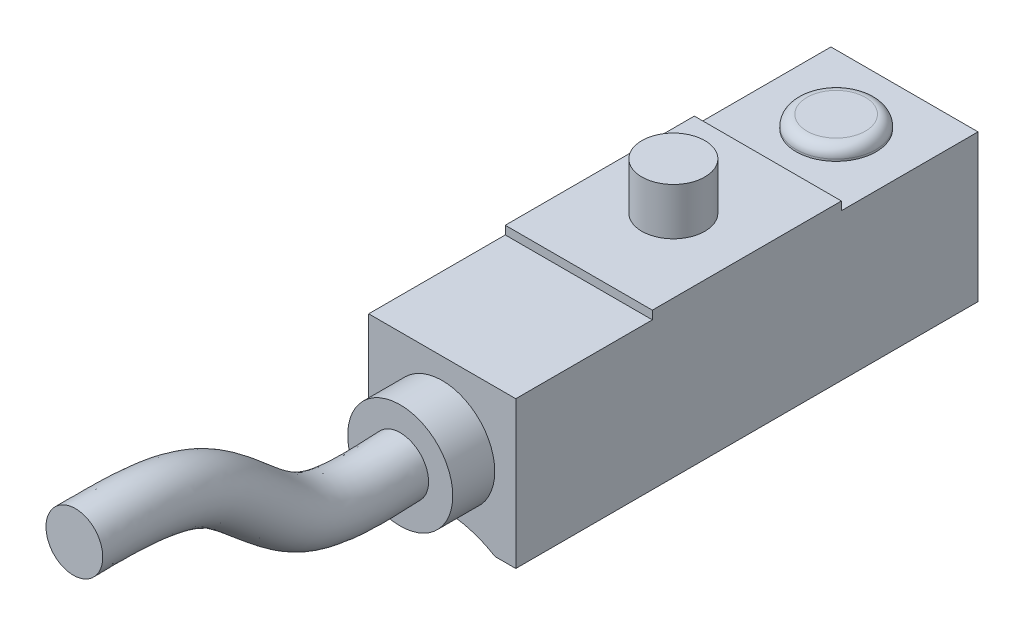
ISO-10303-21;
HEADER;
FILE_DESCRIPTION(('STEP AP214'),'2;1');
FILE_NAME('part.step','',(''),(''),'','','');
FILE_SCHEMA(('AUTOMOTIVE_DESIGN { 1 0 10303 214 1 1 1 1 }'));
ENDSEC;
DATA;
#1=APPLICATION_CONTEXT('core data for automotive mechanical design processes');
#2=APPLICATION_PROTOCOL_DEFINITION('international standard','automotive_design',2000,#1);
#3=PRODUCT_CONTEXT('',#1,'mechanical');
#4=PRODUCT('Part','Part','',(#3));
#5=PRODUCT_RELATED_PRODUCT_CATEGORY('part','',(#4));
#6=PRODUCT_DEFINITION_FORMATION('','',#4);
#7=PRODUCT_DEFINITION_CONTEXT('part definition',#1,'design');
#8=PRODUCT_DEFINITION('design','',#6,#7);
#9=PRODUCT_DEFINITION_SHAPE('','',#8);
#10=(LENGTH_UNIT() NAMED_UNIT(*) SI_UNIT(.MILLI.,.METRE.));
#11=(NAMED_UNIT(*) PLANE_ANGLE_UNIT() SI_UNIT($,.RADIAN.));
#12=(NAMED_UNIT(*) SI_UNIT($,.STERADIAN.) SOLID_ANGLE_UNIT());
#13=UNCERTAINTY_MEASURE_WITH_UNIT(LENGTH_MEASURE(1.E-05),#10,'distance_accuracy_value','');
#14=(GEOMETRIC_REPRESENTATION_CONTEXT(3) GLOBAL_UNCERTAINTY_ASSIGNED_CONTEXT((#13)) GLOBAL_UNIT_ASSIGNED_CONTEXT((#10,
#11,#12)) REPRESENTATION_CONTEXT('',''));
#15=CARTESIAN_POINT('',(0.,0.,0.));
#16=DIRECTION('',(0.,0.,1.));
#17=DIRECTION('',(1.,0.,0.));
#18=AXIS2_PLACEMENT_3D('',#15,#16,#17);
#19=CARTESIAN_POINT('',(-3.5,3.9,6.5));
#20=DIRECTION('',(1.,0.,0.));
#21=DIRECTION('',(0.,0.,-1.));
#22=AXIS2_PLACEMENT_3D('',#19,#20,#21);
#23=PLANE('',#22);
#24=DIRECTION('',(0.,-1.,0.));
#25=VECTOR('',#24,1.);
#26=CARTESIAN_POINT('',(-3.5,3.9,6.5));
#27=LINE('',#26,#25);
#28=CARTESIAN_POINT('',(-3.5,3.9,6.5));
#29=VERTEX_POINT('',#28);
#30=CARTESIAN_POINT('',(-3.5,3.5,6.5));
#31=VERTEX_POINT('',#30);
#32=EDGE_CURVE('E166',#29,#31,#27,.T.);
#33=ORIENTED_EDGE('',*,*,#32,.T.);
#34=DIRECTION('',(0.,0.,-1.));
#35=VECTOR('',#34,1.);
#36=CARTESIAN_POINT('',(-3.5,3.5,22.));
#37=LINE('',#36,#35);
#38=CARTESIAN_POINT('',(-3.5,3.5,0.));
#39=VERTEX_POINT('',#38);
#40=EDGE_CURVE('E191',#31,#39,#37,.T.);
#41=ORIENTED_EDGE('',*,*,#40,.T.);
#42=DIRECTION('',(0.,-1.,0.));
#43=VECTOR('',#42,1.);
#44=CARTESIAN_POINT('',(-3.5,3.5,0.));
#45=LINE('',#44,#43);
#46=CARTESIAN_POINT('',(-3.5,-3.5,0.));
#47=VERTEX_POINT('',#46);
#48=EDGE_CURVE('E135',#39,#47,#45,.T.);
#49=ORIENTED_EDGE('',*,*,#48,.T.);
#50=DIRECTION('',(0.,0.,-1.));
#51=VECTOR('',#50,1.);
#52=CARTESIAN_POINT('',(-3.5,-3.5,22.));
#53=LINE('',#52,#51);
#54=CARTESIAN_POINT('',(-3.5,-3.5,22.));
#55=VERTEX_POINT('',#54);
#56=EDGE_CURVE('E114',#55,#47,#53,.T.);
#57=ORIENTED_EDGE('',*,*,#56,.F.);
#58=DIRECTION('',(0.,-1.,0.));
#59=VECTOR('',#58,1.);
#60=CARTESIAN_POINT('',(-3.5,3.5,22.));
#61=LINE('',#60,#59);
#62=CARTESIAN_POINT('',(-3.5,3.5,22.));
#63=VERTEX_POINT('',#62);
#64=EDGE_CURVE('E121',#63,#55,#61,.T.);
#65=ORIENTED_EDGE('',*,*,#64,.F.);
#66=CARTESIAN_POINT('',(-3.5,3.5,15.5));
#67=VERTEX_POINT('',#66);
#68=EDGE_CURVE('E188',#63,#67,#37,.T.);
#69=ORIENTED_EDGE('',*,*,#68,.T.);
#70=DIRECTION('',(0.,-1.,0.));
#71=VECTOR('',#70,1.);
#72=CARTESIAN_POINT('',(-3.5,3.9,15.5));
#73=LINE('',#72,#71);
#74=CARTESIAN_POINT('',(-3.5,3.9,15.5));
#75=VERTEX_POINT('',#74);
#76=EDGE_CURVE('E11',#75,#67,#73,.T.);
#77=ORIENTED_EDGE('',*,*,#76,.F.);
#78=DIRECTION('',(0.,0.,1.));
#79=VECTOR('',#78,1.);
#80=CARTESIAN_POINT('',(-3.5,3.9,6.5));
#81=LINE('',#80,#79);
#82=EDGE_CURVE('E158',#29,#75,#81,.T.);
#83=ORIENTED_EDGE('',*,*,#82,.F.);
#84=EDGE_LOOP('',(#33,#41,#49,#57,#65,#69,#77,#83));
#85=FACE_BOUND('',#84,.T.);
#86=ADVANCED_FACE('F38',(#85),#23,.F.);
#87=CARTESIAN_POINT('',(-3.5,3.9,15.5));
#88=DIRECTION('',(0.,0.,-1.));
#89=DIRECTION('',(-1.,0.,0.));
#90=AXIS2_PLACEMENT_3D('',#87,#88,#89);
#91=PLANE('',#90);
#92=DIRECTION('',(1.,0.,0.));
#93=VECTOR('',#92,1.);
#94=CARTESIAN_POINT('',(-3.5,3.5,15.5));
#95=LINE('',#94,#93);
#96=CARTESIAN_POINT('',(3.5,3.5,15.5));
#97=VERTEX_POINT('',#96);
#98=EDGE_CURVE('E157',#67,#97,#95,.T.);
#99=ORIENTED_EDGE('',*,*,#98,.T.);
#100=DIRECTION('',(0.,-1.,0.));
#101=VECTOR('',#100,1.);
#102=CARTESIAN_POINT('',(3.5,3.9,15.5));
#103=LINE('',#102,#101);
#104=CARTESIAN_POINT('',(3.5,3.9,15.5));
#105=VERTEX_POINT('',#104);
#106=EDGE_CURVE('E46',#105,#97,#103,.T.);
#107=ORIENTED_EDGE('',*,*,#106,.F.);
#108=DIRECTION('',(1.,0.,0.));
#109=VECTOR('',#108,1.);
#110=CARTESIAN_POINT('',(-3.5,3.9,15.5));
#111=LINE('',#110,#109);
#112=EDGE_CURVE('E160',#75,#105,#111,.T.);
#113=ORIENTED_EDGE('',*,*,#112,.F.);
#114=ORIENTED_EDGE('',*,*,#76,.T.);
#115=EDGE_LOOP('',(#99,#107,#113,#114));
#116=FACE_BOUND('',#115,.T.);
#117=ADVANCED_FACE('F184',(#116),#91,.F.);
#118=CARTESIAN_POINT('',(3.5,3.9,6.5));
#119=DIRECTION('',(-1.,0.,0.));
#120=DIRECTION('',(0.,0.,1.));
#121=AXIS2_PLACEMENT_3D('',#118,#119,#120);
#122=PLANE('',#121);
#123=ORIENTED_EDGE('',*,*,#106,.T.);
#124=DIRECTION('',(0.,0.,-1.));
#125=VECTOR('',#124,1.);
#126=CARTESIAN_POINT('',(3.5,3.5,22.));
#127=LINE('',#126,#125);
#128=CARTESIAN_POINT('',(3.5,3.5,22.));
#129=VERTEX_POINT('',#128);
#130=EDGE_CURVE('E181',#129,#97,#127,.T.);
#131=ORIENTED_EDGE('',*,*,#130,.F.);
#132=DIRECTION('',(0.,1.,0.));
#133=VECTOR('',#132,1.);
#134=CARTESIAN_POINT('',(3.5,3.5,22.));
#135=LINE('',#134,#133);
#136=CARTESIAN_POINT('',(3.5,-3.5,22.));
#137=VERTEX_POINT('',#136);
#138=EDGE_CURVE('E225',#137,#129,#135,.T.);
#139=ORIENTED_EDGE('',*,*,#138,.F.);
#140=DIRECTION('',(0.,0.,-1.));
#141=VECTOR('',#140,1.);
#142=CARTESIAN_POINT('',(3.5,-3.5,22.));
#143=LINE('',#142,#141);
#144=CARTESIAN_POINT('',(3.5,-3.5,0.));
#145=VERTEX_POINT('',#144);
#146=EDGE_CURVE('E197',#137,#145,#143,.T.);
#147=ORIENTED_EDGE('',*,*,#146,.T.);
#148=DIRECTION('',(0.,1.,0.));
#149=VECTOR('',#148,1.);
#150=CARTESIAN_POINT('',(3.5,3.5,0.));
#151=LINE('',#150,#149);
#152=CARTESIAN_POINT('',(3.5,3.5,0.));
#153=VERTEX_POINT('',#152);
#154=EDGE_CURVE('E216',#145,#153,#151,.T.);
#155=ORIENTED_EDGE('',*,*,#154,.T.);
#156=CARTESIAN_POINT('',(3.5,3.5,6.5));
#157=VERTEX_POINT('',#156);
#158=EDGE_CURVE('E190',#157,#153,#127,.T.);
#159=ORIENTED_EDGE('',*,*,#158,.F.);
#160=DIRECTION('',(0.,-1.,0.));
#161=VECTOR('',#160,1.);
#162=CARTESIAN_POINT('',(3.5,3.9,6.5));
#163=LINE('',#162,#161);
#164=CARTESIAN_POINT('',(3.5,3.9,6.5));
#165=VERTEX_POINT('',#164);
#166=EDGE_CURVE('E172',#165,#157,#163,.T.);
#167=ORIENTED_EDGE('',*,*,#166,.F.);
#168=DIRECTION('',(0.,0.,-1.));
#169=VECTOR('',#168,1.);
#170=CARTESIAN_POINT('',(3.5,3.9,6.5));
#171=LINE('',#170,#169);
#172=EDGE_CURVE('E163',#105,#165,#171,.T.);
#173=ORIENTED_EDGE('',*,*,#172,.F.);
#174=EDGE_LOOP('',(#123,#131,#139,#147,#155,#159,#167,#173));
#175=FACE_BOUND('',#174,.T.);
#176=ADVANCED_FACE('F179',(#175),#122,.F.);
#177=CARTESIAN_POINT('',(-3.5,3.9,6.5));
#178=DIRECTION('',(0.,0.,1.));
#179=DIRECTION('',(1.,0.,0.));
#180=AXIS2_PLACEMENT_3D('',#177,#178,#179);
#181=PLANE('',#180);
#182=DIRECTION('',(-1.,0.,0.));
#183=VECTOR('',#182,1.);
#184=CARTESIAN_POINT('',(-3.5,3.5,6.5));
#185=LINE('',#184,#183);
#186=EDGE_CURVE('E161',#157,#31,#185,.T.);
#187=ORIENTED_EDGE('',*,*,#186,.T.);
#188=ORIENTED_EDGE('',*,*,#32,.F.);
#189=DIRECTION('',(-1.,0.,0.));
#190=VECTOR('',#189,1.);
#191=CARTESIAN_POINT('',(-3.5,3.9,6.5));
#192=LINE('',#191,#190);
#193=EDGE_CURVE('E53',#165,#29,#192,.T.);
#194=ORIENTED_EDGE('',*,*,#193,.F.);
#195=ORIENTED_EDGE('',*,*,#166,.T.);
#196=EDGE_LOOP('',(#187,#188,#194,#195));
#197=FACE_BOUND('',#196,.T.);
#198=ADVANCED_FACE('F263',(#197),#181,.F.);
#199=CARTESIAN_POINT('',(-3.5,3.9,15.5));
#200=DIRECTION('',(0.,1.,0.));
#201=DIRECTION('',(0.,0.,1.));
#202=AXIS2_PLACEMENT_3D('',#199,#200,#201);
#203=PLANE('',#202);
#204=CARTESIAN_POINT('',(0.,3.9,11.));
#205=DIRECTION('',(0.,1.,0.));
#206=DIRECTION('',(0.,0.,1.));
#207=AXIS2_PLACEMENT_3D('',#204,#205,#206);
#208=CIRCLE('',#207,1.5);
#209=CARTESIAN_POINT('',(0.,3.9,12.5));
#210=VERTEX_POINT('',#209);
#211=EDGE_CURVE('E154',#210,#210,#208,.T.);
#212=ORIENTED_EDGE('',*,*,#211,.F.);
#213=EDGE_LOOP('',(#212));
#214=FACE_BOUND('',#213,.T.);
#215=ORIENTED_EDGE('',*,*,#82,.T.);
#216=ORIENTED_EDGE('',*,*,#112,.T.);
#217=ORIENTED_EDGE('',*,*,#172,.T.);
#218=ORIENTED_EDGE('',*,*,#193,.T.);
#219=EDGE_LOOP('',(#215,#216,#217,#218));
#220=FACE_BOUND('',#219,.T.);
#221=ADVANCED_FACE('F268',(#214,#220),#203,.T.);
#222=CARTESIAN_POINT('',(0.,6.14,11.));
#223=DIRECTION('',(0.,-1.,0.));
#224=DIRECTION('',(0.,0.,-1.));
#225=AXIS2_PLACEMENT_3D('',#222,#223,#224);
#226=CYLINDRICAL_SURFACE('',#225,1.5);
#227=ORIENTED_EDGE('',*,*,#211,.T.);
#228=EDGE_LOOP('',(#227));
#229=FACE_BOUND('',#228,.T.);
#230=CARTESIAN_POINT('',(0.,6.14,11.));
#231=DIRECTION('',(0.,1.,0.));
#232=DIRECTION('',(0.,0.,1.));
#233=AXIS2_PLACEMENT_3D('',#230,#231,#232);
#234=CIRCLE('',#233,1.5);
#235=CARTESIAN_POINT('',(0.,6.14,12.5));
#236=VERTEX_POINT('',#235);
#237=EDGE_CURVE('E151',#236,#236,#234,.T.);
#238=ORIENTED_EDGE('',*,*,#237,.F.);
#239=EDGE_LOOP('',(#238));
#240=FACE_BOUND('',#239,.T.);
#241=ADVANCED_FACE('F272',(#229,#240),#226,.T.);
#242=CARTESIAN_POINT('',(0.,6.14,11.));
#243=DIRECTION('',(0.,1.,0.));
#244=DIRECTION('',(0.,0.,1.));
#245=AXIS2_PLACEMENT_3D('',#242,#243,#244);
#246=PLANE('',#245);
#247=ORIENTED_EDGE('',*,*,#237,.T.);
#248=EDGE_LOOP('',(#247));
#249=FACE_BOUND('',#248,.T.);
#250=ADVANCED_FACE('F276',(#249),#246,.T.);
#251=CARTESIAN_POINT('',(-3.5,3.5,22.));
#252=DIRECTION('',(0.,-1.,0.));
#253=DIRECTION('',(0.,0.,-1.));
#254=AXIS2_PLACEMENT_3D('',#251,#252,#253);
#255=PLANE('',#254);
#256=ORIENTED_EDGE('',*,*,#130,.T.);
#257=ORIENTED_EDGE('',*,*,#98,.F.);
#258=ORIENTED_EDGE('',*,*,#68,.F.);
#259=DIRECTION('',(-1.,0.,0.));
#260=VECTOR('',#259,1.);
#261=CARTESIAN_POINT('',(-3.5,3.5,22.));
#262=LINE('',#261,#260);
#263=EDGE_CURVE('E127',#129,#63,#262,.T.);
#264=ORIENTED_EDGE('',*,*,#263,.F.);
#265=EDGE_LOOP('',(#256,#257,#258,#264));
#266=FACE_BOUND('',#265,.T.);
#267=ADVANCED_FACE('F187',(#266),#255,.F.);
#268=CARTESIAN_POINT('',(0.,3.5,3.25));
#269=DIRECTION('',(0.,-1.,0.));
#270=DIRECTION('',(0.,0.,-1.));
#271=AXIS2_PLACEMENT_3D('',#268,#269,#270);
#272=CIRCLE('',#271,1.9);
#273=CARTESIAN_POINT('',(0.,3.5,1.35));
#274=VERTEX_POINT('',#273);
#275=EDGE_CURVE('E136',#274,#274,#272,.F.);
#276=ORIENTED_EDGE('',*,*,#275,.F.);
#277=EDGE_LOOP('',(#276));
#278=FACE_BOUND('',#277,.T.);
#279=ORIENTED_EDGE('',*,*,#40,.F.);
#280=ORIENTED_EDGE('',*,*,#186,.F.);
#281=ORIENTED_EDGE('',*,*,#158,.T.);
#282=DIRECTION('',(-1.,0.,0.));
#283=VECTOR('',#282,1.);
#284=CARTESIAN_POINT('',(-3.5,3.5,0.));
#285=LINE('',#284,#283);
#286=EDGE_CURVE('E131',#153,#39,#285,.T.);
#287=ORIENTED_EDGE('',*,*,#286,.T.);
#288=EDGE_LOOP('',(#279,#280,#281,#287));
#289=FACE_BOUND('',#288,.T.);
#290=ADVANCED_FACE('F290',(#278,#289),#255,.F.);
#291=CARTESIAN_POINT('',(0.,-7.62,22.));
#292=DIRECTION('',(0.,0.,1.));
#293=DIRECTION('',(1.,0.,0.));
#294=AXIS2_PLACEMENT_3D('',#291,#292,#293);
#295=PLANE('',#294);
#296=ORIENTED_EDGE('',*,*,#64,.T.);
#297=DIRECTION('',(1.,0.,0.));
#298=VECTOR('',#297,1.);
#299=CARTESIAN_POINT('',(-3.5,-3.5,22.));
#300=LINE('',#299,#298);
#301=CARTESIAN_POINT('',(-2.51314066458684,-3.5,22.));
#302=VERTEX_POINT('',#301);
#303=EDGE_CURVE('E110',#55,#302,#300,.T.);
#304=ORIENTED_EDGE('',*,*,#303,.T.);
#305=CARTESIAN_POINT('',(0.,-7.62,22.));
#306=DIRECTION('',(0.,0.,-1.));
#307=DIRECTION('',(1.,0.,0.));
#308=AXIS2_PLACEMENT_3D('',#305,#306,#307);
#309=CIRCLE('',#308,4.826);
#310=CARTESIAN_POINT('',(2.51314066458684,-3.5,22.));
#311=VERTEX_POINT('',#310);
#312=EDGE_CURVE('E120',#302,#311,#309,.T.);
#313=ORIENTED_EDGE('',*,*,#312,.T.);
#314=DIRECTION('',(1.,0.,0.));
#315=VECTOR('',#314,1.);
#316=CARTESIAN_POINT('',(2.51314066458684,-3.5,22.));
#317=LINE('',#316,#315);
#318=EDGE_CURVE('E207',#311,#137,#317,.T.);
#319=ORIENTED_EDGE('',*,*,#318,.T.);
#320=ORIENTED_EDGE('',*,*,#138,.T.);
#321=ORIENTED_EDGE('',*,*,#263,.T.);
#322=EDGE_LOOP('',(#296,#304,#313,#319,#320,#321));
#323=FACE_BOUND('',#322,.T.);
#324=CARTESIAN_POINT('',(0.,0.,22.));
#325=DIRECTION('',(0.,0.,1.));
#326=DIRECTION('',(1.,0.,0.));
#327=AXIS2_PLACEMENT_3D('',#324,#325,#326);
#328=CIRCLE('',#327,2.5);
#329=CARTESIAN_POINT('',(2.5,0.,22.));
#330=VERTEX_POINT('',#329);
#331=EDGE_CURVE('E229',#330,#330,#328,.T.);
#332=ORIENTED_EDGE('',*,*,#331,.F.);
#333=EDGE_LOOP('',(#332));
#334=FACE_BOUND('',#333,.T.);
#335=ADVANCED_FACE('F124',(#323,#334),#295,.T.);
#336=CARTESIAN_POINT('',(-3.5,-3.5,22.));
#337=DIRECTION('',(0.,1.,0.));
#338=DIRECTION('',(-1.,0.,0.));
#339=AXIS2_PLACEMENT_3D('',#336,#337,#338);
#340=PLANE('',#339);
#341=DIRECTION('',(1.,0.,0.));
#342=VECTOR('',#341,1.);
#343=CARTESIAN_POINT('',(-3.5,-3.5,0.));
#344=LINE('',#343,#342);
#345=CARTESIAN_POINT('',(-2.51314066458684,-3.5,0.));
#346=VERTEX_POINT('',#345);
#347=EDGE_CURVE('E218',#47,#346,#344,.T.);
#348=ORIENTED_EDGE('',*,*,#347,.T.);
#349=DIRECTION('',(0.,0.,-1.));
#350=VECTOR('',#349,1.);
#351=CARTESIAN_POINT('',(-2.51314066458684,-3.5,22.));
#352=LINE('',#351,#350);
#353=EDGE_CURVE('E117',#302,#346,#352,.T.);
#354=ORIENTED_EDGE('',*,*,#353,.F.);
#355=ORIENTED_EDGE('',*,*,#303,.F.);
#356=ORIENTED_EDGE('',*,*,#56,.T.);
#357=EDGE_LOOP('',(#348,#354,#355,#356));
#358=FACE_BOUND('',#357,.T.);
#359=ADVANCED_FACE('F112',(#358),#340,.F.);
#360=CARTESIAN_POINT('',(0.,-7.62,22.));
#361=DIRECTION('',(0.,0.,-1.));
#362=DIRECTION('',(-1.,0.,0.));
#363=AXIS2_PLACEMENT_3D('',#360,#361,#362);
#364=CYLINDRICAL_SURFACE('',#363,4.826);
#365=CARTESIAN_POINT('',(0.,-7.62,0.));
#366=DIRECTION('',(0.,0.,-1.));
#367=DIRECTION('',(1.,0.,0.));
#368=AXIS2_PLACEMENT_3D('',#365,#366,#367);
#369=CIRCLE('',#368,4.826);
#370=CARTESIAN_POINT('',(2.51314066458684,-3.5,0.));
#371=VERTEX_POINT('',#370);
#372=EDGE_CURVE('E213',#346,#371,#369,.T.);
#373=ORIENTED_EDGE('',*,*,#372,.T.);
#374=DIRECTION('',(0.,0.,-1.));
#375=VECTOR('',#374,1.);
#376=CARTESIAN_POINT('',(2.51314066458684,-3.5,22.));
#377=LINE('',#376,#375);
#378=EDGE_CURVE('E141',#311,#371,#377,.T.);
#379=ORIENTED_EDGE('',*,*,#378,.F.);
#380=ORIENTED_EDGE('',*,*,#312,.F.);
#381=ORIENTED_EDGE('',*,*,#353,.T.);
#382=EDGE_LOOP('',(#373,#379,#380,#381));
#383=FACE_BOUND('',#382,.T.);
#384=ADVANCED_FACE('F283',(#383),#364,.F.);
#385=CARTESIAN_POINT('',(2.51314066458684,-3.5,22.));
#386=DIRECTION('',(0.,1.,0.));
#387=DIRECTION('',(-1.,0.,0.));
#388=AXIS2_PLACEMENT_3D('',#385,#386,#387);
#389=PLANE('',#388);
#390=DIRECTION('',(1.,0.,0.));
#391=VECTOR('',#390,1.);
#392=CARTESIAN_POINT('',(2.51314066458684,-3.5,0.));
#393=LINE('',#392,#391);
#394=EDGE_CURVE('E206',#371,#145,#393,.T.);
#395=ORIENTED_EDGE('',*,*,#394,.T.);
#396=ORIENTED_EDGE('',*,*,#146,.F.);
#397=ORIENTED_EDGE('',*,*,#318,.F.);
#398=ORIENTED_EDGE('',*,*,#378,.T.);
#399=EDGE_LOOP('',(#395,#396,#397,#398));
#400=FACE_BOUND('',#399,.T.);
#401=ADVANCED_FACE('F204',(#400),#389,.F.);
#402=CARTESIAN_POINT('',(0.,-7.62,0.));
#403=DIRECTION('',(0.,0.,1.));
#404=DIRECTION('',(1.,0.,0.));
#405=AXIS2_PLACEMENT_3D('',#402,#403,#404);
#406=PLANE('',#405);
#407=ORIENTED_EDGE('',*,*,#48,.F.);
#408=ORIENTED_EDGE('',*,*,#286,.F.);
#409=ORIENTED_EDGE('',*,*,#154,.F.);
#410=ORIENTED_EDGE('',*,*,#394,.F.);
#411=ORIENTED_EDGE('',*,*,#372,.F.);
#412=ORIENTED_EDGE('',*,*,#347,.F.);
#413=EDGE_LOOP('',(#407,#408,#409,#410,#411,#412));
#414=FACE_BOUND('',#413,.T.);
#415=ADVANCED_FACE('F212',(#414),#406,.F.);
#416=CARTESIAN_POINT('',(0.,0.,24.));
#417=DIRECTION('',(0.,0.,-1.));
#418=DIRECTION('',(-1.,0.,0.));
#419=AXIS2_PLACEMENT_3D('',#416,#417,#418);
#420=CYLINDRICAL_SURFACE('',#419,2.5);
#421=CARTESIAN_POINT('',(0.,0.,24.));
#422=DIRECTION('',(0.,0.,1.));
#423=DIRECTION('',(1.,0.,0.));
#424=AXIS2_PLACEMENT_3D('',#421,#422,#423);
#425=CIRCLE('',#424,2.5);
#426=CARTESIAN_POINT('',(2.5,0.,24.));
#427=VERTEX_POINT('',#426);
#428=EDGE_CURVE('E223',#427,#427,#425,.T.);
#429=ORIENTED_EDGE('',*,*,#428,.F.);
#430=EDGE_LOOP('',(#429));
#431=FACE_BOUND('',#430,.T.);
#432=ORIENTED_EDGE('',*,*,#331,.T.);
#433=EDGE_LOOP('',(#432));
#434=FACE_BOUND('',#433,.T.);
#435=ADVANCED_FACE('F293',(#431,#434),#420,.T.);
#436=CARTESIAN_POINT('',(0.,0.,24.));
#437=DIRECTION('',(0.,0.,1.));
#438=DIRECTION('',(1.,0.,0.));
#439=AXIS2_PLACEMENT_3D('',#436,#437,#438);
#440=PLANE('',#439);
#441=CARTESIAN_POINT('',(0.,0.,24.));
#442=DIRECTION('',(0.,0.,1.));
#443=DIRECTION('',(1.,0.,0.));
#444=AXIS2_PLACEMENT_3D('',#441,#442,#443);
#445=CIRCLE('',#444,1.35);
#446=CARTESIAN_POINT('',(1.35,0.,24.));
#447=VERTEX_POINT('',#446);
#448=EDGE_CURVE('E150',#447,#447,#445,.T.);
#449=ORIENTED_EDGE('',*,*,#448,.F.);
#450=EDGE_LOOP('',(#449));
#451=FACE_BOUND('',#450,.T.);
#452=ORIENTED_EDGE('',*,*,#428,.T.);
#453=EDGE_LOOP('',(#452));
#454=FACE_BOUND('',#453,.T.);
#455=ADVANCED_FACE('F298',(#451,#454),#440,.T.);
#456=CARTESIAN_POINT('',(0.,4.1,3.25));
#457=DIRECTION('',(0.,-1.,0.));
#458=DIRECTION('',(0.,0.,-1.));
#459=AXIS2_PLACEMENT_3D('',#456,#457,#458);
#460=CYLINDRICAL_SURFACE('',#459,1.9);
#461=CARTESIAN_POINT('',(0.,3.592,3.25));
#462=DIRECTION('',(0.,1.,0.));
#463=DIRECTION('',(0.,0.,1.));
#464=AXIS2_PLACEMENT_3D('',#461,#462,#463);
#465=CIRCLE('',#464,1.9);
#466=CARTESIAN_POINT('',(0.,3.592,5.15));
#467=VERTEX_POINT('',#466);
#468=EDGE_CURVE('E147',#467,#467,#465,.F.);
#469=ORIENTED_EDGE('',*,*,#468,.T.);
#470=EDGE_LOOP('',(#469));
#471=FACE_BOUND('',#470,.T.);
#472=ORIENTED_EDGE('',*,*,#275,.T.);
#473=EDGE_LOOP('',(#472));
#474=FACE_BOUND('',#473,.T.);
#475=ADVANCED_FACE('F302',(#471,#474),#460,.T.);
#476=CARTESIAN_POINT('',(0.,4.1,3.25));
#477=DIRECTION('',(0.,1.,0.));
#478=DIRECTION('',(0.,0.,1.));
#479=AXIS2_PLACEMENT_3D('',#476,#477,#478);
#480=PLANE('',#479);
#481=CARTESIAN_POINT('',(0.,4.1,3.25));
#482=DIRECTION('',(0.,1.,0.));
#483=DIRECTION('',(0.,0.,1.));
#484=AXIS2_PLACEMENT_3D('',#481,#482,#483);
#485=CIRCLE('',#484,1.392);
#486=CARTESIAN_POINT('',(0.,4.1,4.642));
#487=VERTEX_POINT('',#486);
#488=EDGE_CURVE('E139',#487,#487,#485,.T.);
#489=ORIENTED_EDGE('',*,*,#488,.T.);
#490=EDGE_LOOP('',(#489));
#491=FACE_BOUND('',#490,.T.);
#492=ADVANCED_FACE('F252',(#491),#480,.T.);
#493=CARTESIAN_POINT('',(0.,3.592,3.25));
#494=DIRECTION('',(0.,1.,0.));
#495=DIRECTION('',(0.,0.,1.));
#496=AXIS2_PLACEMENT_3D('',#493,#494,#495);
#497=TOROIDAL_SURFACE('',#496,1.392,0.508);
#498=ORIENTED_EDGE('',*,*,#468,.F.);
#499=EDGE_LOOP('',(#498));
#500=FACE_BOUND('',#499,.T.);
#501=ORIENTED_EDGE('',*,*,#488,.F.);
#502=EDGE_LOOP('',(#501));
#503=FACE_BOUND('',#502,.T.);
#504=ADVANCED_FACE('F244',(#500,#503),#497,.T.);
#505=CARTESIAN_POINT('',(-1.35,4.60058880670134,39.5080887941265));
#506=DIRECTION('',(0.,-0.0375356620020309,-0.999295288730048));
#507=DIRECTION('',(0.,0.999295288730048,-0.0375356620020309));
#508=AXIS2_PLACEMENT_3D('',#505,#506,#507);
#509=PLANE('',#508);
#510=CARTESIAN_POINT('',(0.,4.60058880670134,39.5080887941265));
#511=DIRECTION('',(0.,-0.0375356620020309,-0.999295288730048));
#512=DIRECTION('',(0.,0.999295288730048,-0.0375356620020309));
#513=AXIS2_PLACEMENT_3D('',#510,#511,#512);
#514=CIRCLE('',#513,1.35);
#515=CARTESIAN_POINT('',(1.35,4.60058880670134,39.5080887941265));
#516=VERTEX_POINT('',#515);
#517=EDGE_CURVE('E232',#516,#516,#514,.T.);
#518=ORIENTED_EDGE('',*,*,#517,.F.);
#519=EDGE_LOOP('',(#518));
#520=FACE_BOUND('',#519,.T.);
#521=ADVANCED_FACE('F242',(#520),#509,.F.);
#522=CARTESIAN_POINT('',(1.35,0.,24.));
#523=CARTESIAN_POINT('',(1.35,-0.0409752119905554,24.815779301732));
#524=CARTESIAN_POINT('',(1.35,-0.122925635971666,26.447337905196));
#525=CARTESIAN_POINT('',(1.35,0.126840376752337,27.9833004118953));
#526=CARTESIAN_POINT('',(1.35,0.711426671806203,29.3618720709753));
#527=CARTESIAN_POINT('',(1.35,1.62928132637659,30.6139502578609));
#528=CARTESIAN_POINT('',(1.35,2.91196146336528,32.023132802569));
#529=CARTESIAN_POINT('',(1.35,3.77663897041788,33.3441863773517));
#530=CARTESIAN_POINT('',(1.35,4.35927631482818,34.816482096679));
#531=CARTESIAN_POINT('',(1.35,4.63307961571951,36.9380853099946));
#532=CARTESIAN_POINT('',(1.35,4.61141907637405,38.651420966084));
#533=CARTESIAN_POINT('',(1.35,4.60058880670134,39.5080887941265));
#534=CARTESIAN_POINT('',(1.35,2.7,24.));
#535=CARTESIAN_POINT('',(1.35,2.66763499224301,24.7796550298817));
#536=CARTESIAN_POINT('',(1.35,2.60290497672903,26.3389650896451));
#537=CARTESIAN_POINT('',(1.35,2.70760517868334,27.1211545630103));
#538=CARTESIAN_POINT('',(1.35,2.99990355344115,27.8888695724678));
#539=CARTESIAN_POINT('',(1.35,3.49682108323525,28.6604305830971));
#540=CARTESIAN_POINT('',(1.35,4.91428241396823,30.1654192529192));
#541=CARTESIAN_POINT('',(1.35,6.0927527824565,31.979071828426));
#542=CARTESIAN_POINT('',(1.35,7.01522932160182,34.0915170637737));
#543=CARTESIAN_POINT('',(1.35,7.32291245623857,36.7336817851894));
#544=CARTESIAN_POINT('',(1.35,7.30676154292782,38.515722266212));
#545=CARTESIAN_POINT('',(1.35,7.29868608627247,39.406742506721));
#546=CARTESIAN_POINT('',(-1.35,2.7,24.));
#547=CARTESIAN_POINT('',(-1.35,2.66763499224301,24.7796550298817));
#548=CARTESIAN_POINT('',(-1.35,2.60290497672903,26.3389650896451));
#549=CARTESIAN_POINT('',(-1.35,2.70760517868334,27.1211545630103));
#550=CARTESIAN_POINT('',(-1.35,2.99990355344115,27.8888695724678));
#551=CARTESIAN_POINT('',(-1.35,3.49682108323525,28.6604305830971));
#552=CARTESIAN_POINT('',(-1.35,4.91428241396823,30.1654192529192));
#553=CARTESIAN_POINT('',(-1.35,6.0927527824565,31.979071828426));
#554=CARTESIAN_POINT('',(-1.35,7.01522932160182,34.0915170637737));
#555=CARTESIAN_POINT('',(-1.35,7.32291245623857,36.7336817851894));
#556=CARTESIAN_POINT('',(-1.35,7.30676154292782,38.515722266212));
#557=CARTESIAN_POINT('',(-1.35,7.29868608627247,39.406742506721));
#558=CARTESIAN_POINT('',(-1.35,0.,24.));
#559=CARTESIAN_POINT('',(-1.35,-0.0409752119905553,24.815779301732));
#560=CARTESIAN_POINT('',(-1.35,-0.122925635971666,26.447337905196));
#561=CARTESIAN_POINT('',(-1.35,0.126840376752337,27.9833004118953));
#562=CARTESIAN_POINT('',(-1.35,0.711426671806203,29.3618720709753));
#563=CARTESIAN_POINT('',(-1.35,1.62928132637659,30.6139502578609));
#564=CARTESIAN_POINT('',(-1.35,2.91196146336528,32.023132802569));
#565=CARTESIAN_POINT('',(-1.35,3.77663897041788,33.3441863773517));
#566=CARTESIAN_POINT('',(-1.35,4.35927631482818,34.816482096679));
#567=CARTESIAN_POINT('',(-1.35,4.63307961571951,36.9380853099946));
#568=CARTESIAN_POINT('',(-1.35,4.61141907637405,38.651420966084));
#569=CARTESIAN_POINT('',(-1.35,4.60058880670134,39.5080887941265));
#570=CARTESIAN_POINT('',(-1.35,-2.7,24.));
#571=CARTESIAN_POINT('',(-1.35,-2.74958541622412,24.8519035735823));
#572=CARTESIAN_POINT('',(-1.35,-2.84875624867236,26.5557107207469));
#573=CARTESIAN_POINT('',(-1.35,-2.45392442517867,28.8454462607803));
#574=CARTESIAN_POINT('',(-1.35,-1.57705020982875,30.8348745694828));
#575=CARTESIAN_POINT('',(-1.35,-0.238258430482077,32.5674699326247));
#576=CARTESIAN_POINT('',(-1.35,0.909640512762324,33.8808463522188));
#577=CARTESIAN_POINT('',(-1.35,1.46052515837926,34.7093009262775));
#578=CARTESIAN_POINT('',(-1.35,1.70332330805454,35.5414471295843));
#579=CARTESIAN_POINT('',(-1.35,1.94324677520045,37.1424888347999));
#580=CARTESIAN_POINT('',(-1.35,1.91607660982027,38.787119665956));
#581=CARTESIAN_POINT('',(-1.35,1.90249152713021,39.609435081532));
#582=CARTESIAN_POINT('',(1.35,-2.7,24.));
#583=CARTESIAN_POINT('',(1.35,-2.74958541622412,24.8519035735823));
#584=CARTESIAN_POINT('',(1.35,-2.84875624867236,26.5557107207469));
#585=CARTESIAN_POINT('',(1.35,-2.45392442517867,28.8454462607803));
#586=CARTESIAN_POINT('',(1.35,-1.57705020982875,30.8348745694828));
#587=CARTESIAN_POINT('',(1.35,-0.238258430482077,32.5674699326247));
#588=CARTESIAN_POINT('',(1.35,0.909640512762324,33.8808463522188));
#589=CARTESIAN_POINT('',(1.35,1.46052515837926,34.7093009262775));
#590=CARTESIAN_POINT('',(1.35,1.70332330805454,35.5414471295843));
#591=CARTESIAN_POINT('',(1.35,1.94324677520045,37.1424888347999));
#592=CARTESIAN_POINT('',(1.35,1.91607660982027,38.787119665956));
#593=CARTESIAN_POINT('',(1.35,1.90249152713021,39.609435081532));
#594=CARTESIAN_POINT('',(1.35,0.,24.));
#595=CARTESIAN_POINT('',(1.35,-0.0409752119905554,24.815779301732));
#596=CARTESIAN_POINT('',(1.35,-0.122925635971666,26.447337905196));
#597=CARTESIAN_POINT('',(1.35,0.126840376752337,27.9833004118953));
#598=CARTESIAN_POINT('',(1.35,0.711426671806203,29.3618720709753));
#599=CARTESIAN_POINT('',(1.35,1.62928132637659,30.6139502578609));
#600=CARTESIAN_POINT('',(1.35,2.91196146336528,32.023132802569));
#601=CARTESIAN_POINT('',(1.35,3.77663897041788,33.3441863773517));
#602=CARTESIAN_POINT('',(1.35,4.35927631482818,34.816482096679));
#603=CARTESIAN_POINT('',(1.35,4.63307961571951,36.9380853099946));
#604=CARTESIAN_POINT('',(1.35,4.61141907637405,38.651420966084));
#605=CARTESIAN_POINT('',(1.35,4.60058880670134,39.5080887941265));
#606=(BOUNDED_SURFACE() B_SPLINE_SURFACE(3,3,((#522,#523,#524,#525,#526,#527,#528,#529,#530,
#531,#532,#533),(#534,#535,#536,#537,#538,#539,#540,#541,#542,#543,#544,#545),(#546,#547,#548,
#549,#550,#551,#552,#553,#554,#555,#556,#557),(#558,#559,#560,#561,#562,#563,#564,#565,#566,
#567,#568,#569),(#570,#571,#572,#573,#574,#575,#576,#577,#578,#579,#580,#581),(#582,#583,#584,
#585,#586,#587,#588,#589,#590,#591,#592,#593),(#594,#595,#596,#597,#598,#599,#600,#601,#602,
#603,#604,#605)),.UNSPECIFIED.,.T.,.F.,.F.) B_SPLINE_SURFACE_WITH_KNOTS((4,3,4),(4,1,1,1,1,1,1,
1,1,4),(0.,0.5,1.),(0.,0.14,0.28,0.285302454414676,0.420000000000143,0.559999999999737,
0.616135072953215,0.706666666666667,0.85333333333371,1.),
.UNSPECIFIED.) GEOMETRIC_REPRESENTATION_ITEM() RATIONAL_B_SPLINE_SURFACE(((1.,1.,1.,1.,1.,1.,1.,
1.,1.,1.,1.,1.),(0.333333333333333,0.333333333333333,0.333333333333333,0.333333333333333,
0.333333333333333,0.333333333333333,0.333333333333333,0.333333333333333,0.333333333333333,
0.333333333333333,0.333333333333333,0.333333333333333),(0.333333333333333,0.333333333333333,
0.333333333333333,0.333333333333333,0.333333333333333,0.333333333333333,0.333333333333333,
0.333333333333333,0.333333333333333,0.333333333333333,0.333333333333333,0.333333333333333),(1.,
1.,1.,1.,1.,1.,1.,1.,1.,1.,1.,1.),(0.333333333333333,0.333333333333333,0.333333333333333,
0.333333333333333,0.333333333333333,0.333333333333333,0.333333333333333,0.333333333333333,
0.333333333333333,0.333333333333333,0.333333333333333,0.333333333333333),(0.333333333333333,
0.333333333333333,0.333333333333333,0.333333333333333,0.333333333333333,0.333333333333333,
0.333333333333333,0.333333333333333,0.333333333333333,0.333333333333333,0.333333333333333,
0.333333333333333),(1.,1.,1.,1.,1.,1.,1.,1.,1.,1.,1.,1.))) REPRESENTATION_ITEM('') SURFACE());
#607=CARTESIAN_POINT('',(1.35,0.,24.));
#608=CARTESIAN_POINT('',(1.35,-0.000571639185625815,24.0113808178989));
#609=CARTESIAN_POINT('',(1.35,-0.00114327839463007,24.0227616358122));
#610=CARTESIAN_POINT('',(1.35,-0.00228611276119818,24.0455231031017));
#611=CARTESIAN_POINT('',(1.35,-0.00285730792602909,24.0569037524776));
#612=CARTESIAN_POINT('',(1.35,-0.00399881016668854,24.0796647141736));
#613=CARTESIAN_POINT('',(1.35,-0.00456911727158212,24.0910450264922));
#614=CARTESIAN_POINT('',(1.35,-0.00570839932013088,24.1138051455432));
#615=CARTESIAN_POINT('',(1.35,-0.00627737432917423,24.1251849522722));
#616=CARTESIAN_POINT('',(1.35,-0.00741354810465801,24.1479438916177));
#617=CARTESIAN_POINT('',(1.35,-0.00798074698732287,24.1593230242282));
#618=CARTESIAN_POINT('',(1.35,-0.00911292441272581,24.1820804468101));
#619=CARTESIAN_POINT('',(1.35,-0.00967790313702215,24.1934587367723));
#620=CARTESIAN_POINT('',(1.35,-0.0108051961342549,24.2162143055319));
#621=CARTESIAN_POINT('',(1.35,-0.0113675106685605,24.2275915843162));
#622=CARTESIAN_POINT('',(1.35,-0.012489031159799,24.250344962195));
#623=CARTESIAN_POINT('',(1.35,-0.013048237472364,24.2617210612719));
#624=CARTESIAN_POINT('',(1.35,-0.0141630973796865,24.2844719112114));
#625=CARTESIAN_POINT('',(1.35,-0.0147187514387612,24.2958466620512));
#626=CARTESIAN_POINT('',(1.35,-0.0158260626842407,24.318594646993));
#627=CARTESIAN_POINT('',(1.35,-0.0163777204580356,24.3299678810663));
#628=CARTESIAN_POINT('',(1.35,-0.0174765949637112,24.3527126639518));
#629=CARTESIAN_POINT('',(1.35,-0.0180238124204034,24.364084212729));
#630=CARTESIAN_POINT('',(1.35,-0.0191133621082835,24.3868254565));
#631=CARTESIAN_POINT('',(1.35,-0.0196556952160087,24.3981951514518));
#632=CARTESIAN_POINT('',(1.35,-0.0207350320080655,24.4209325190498));
#633=CARTESIAN_POINT('',(1.35,-0.0212720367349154,24.4323001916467));
#634=CARTESIAN_POINT('',(1.35,-0.0223402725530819,24.4550333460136));
#635=CARTESIAN_POINT('',(1.35,-0.0228715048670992,24.4663988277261));
#636=CARTESIAN_POINT('',(1.35,-0.0239277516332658,24.4891274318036));
#637=CARTESIAN_POINT('',(1.35,-0.0244527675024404,24.5004905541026));
#638=CARTESIAN_POINT('',(1.35,-0.0254961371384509,24.5232142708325));
#639=CARTESIAN_POINT('',(1.35,-0.026014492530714,24.5345748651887));
#640=CARTESIAN_POINT('',(1.35,-0.0270440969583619,24.5572933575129));
#641=CARTESIAN_POINT('',(1.35,-0.0275553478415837,24.5686512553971));
#642=CARTESIAN_POINT('',(1.35,-0.028570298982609,24.5913641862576));
#643=CARTESIAN_POINT('',(1.35,-0.029074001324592,24.6027192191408));
#644=CARTESIAN_POINT('',(1.35,-0.0300734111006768,24.6254262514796));
#645=CARTESIAN_POINT('',(1.35,-0.0305691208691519,24.6367782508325));
#646=CARTESIAN_POINT('',(1.35,-0.0315521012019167,24.6594790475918));
#647=CARTESIAN_POINT('',(1.35,-0.0320393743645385,24.6708278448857));
#648=CARTESIAN_POINT('',(1.35,-0.0330050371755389,24.6935220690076));
#649=CARTESIAN_POINT('',(1.35,-0.0334834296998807,24.7048674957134));
#650=CARTESIAN_POINT('',(1.35,-0.0344308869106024,24.7275548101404));
#651=CARTESIAN_POINT('',(1.35,-0.0348999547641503,24.7388966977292));
#652=CARTESIAN_POINT('',(1.35,-0.0358283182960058,24.7615767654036));
#653=CARTESIAN_POINT('',(1.35,-0.0362876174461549,24.7729149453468));
#654=CARTESIAN_POINT('',(1.35,-0.0371959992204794,24.795587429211));
#655=CARTESIAN_POINT('',(1.35,-0.0376450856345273,24.80692173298));
#656=CARTESIAN_POINT('',(1.35,-0.0385325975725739,24.8295862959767));
#657=CARTESIAN_POINT('',(1.35,-0.0389710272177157,24.8409165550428));
#658=CARTESIAN_POINT('',(1.35,-0.0398367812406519,24.8635728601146));
#659=CARTESIAN_POINT('',(1.35,-0.0402641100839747,24.8748989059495));
#660=CARTESIAN_POINT('',(1.35,-0.0411072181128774,24.8975466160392));
#661=CARTESIAN_POINT('',(1.35,-0.0415230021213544,24.9088682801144));
#662=CARTESIAN_POINT('',(1.35,-0.042342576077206,24.931507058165));
#663=CARTESIAN_POINT('',(1.35,-0.0427463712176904,24.9428241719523));
#664=CARTESIAN_POINT('',(1.35,-0.0435415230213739,24.9654536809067));
#665=CARTESIAN_POINT('',(1.35,-0.0439328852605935,24.9767660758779));
#666=CARTESIAN_POINT('',(1.35,-0.044702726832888,24.9993859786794));
#667=CARTESIAN_POINT('',(1.35,-0.045081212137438,25.0106934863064));
#668=CARTESIAN_POINT('',(1.35,-0.0458248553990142,25.0333034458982));
#669=CARTESIAN_POINT('',(1.35,-0.0461900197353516,25.0446058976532));
#670=CARTESIAN_POINT('',(1.35,-0.0469065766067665,25.0672055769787));
#671=CARTESIAN_POINT('',(1.35,-0.0472579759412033,25.0785028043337));
#672=CARTESIAN_POINT('',(1.35,-0.0479465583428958,25.1010918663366));
#673=CARTESIAN_POINT('',(1.35,-0.048283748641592,25.1123837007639));
#674=CARTESIAN_POINT('',(1.35,-0.0489434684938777,25.1349618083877));
#675=CARTESIAN_POINT('',(1.35,-0.0492660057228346,25.1462480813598));
#676=CARTESIAN_POINT('',(1.35,-0.0498959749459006,25.1688148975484));
#677=CARTESIAN_POINT('',(1.35,-0.0502034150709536,25.1800954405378));
#678=CARTESIAN_POINT('',(1.35,-0.0508027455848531,25.2026506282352));
#679=CARTESIAN_POINT('',(1.35,-0.0510946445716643,25.2139252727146));
#680=CARTESIAN_POINT('',(1.35,-0.0516624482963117,25.2364684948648));
#681=CARTESIAN_POINT('',(1.35,-0.0519383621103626,25.2477370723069));
#682=CARTESIAN_POINT('',(1.35,-0.0524737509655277,25.2702679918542));
#683=CARTESIAN_POINT('',(1.35,-0.0527332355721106,25.281530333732));
#684=CARTESIAN_POINT('',(1.35,-0.0532353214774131,25.3040486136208));
#685=CARTESIAN_POINT('',(1.35,-0.0534779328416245,25.3153045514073));
#686=CARTESIAN_POINT('',(1.35,-0.0539458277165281,25.3378098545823));
#687=CARTESIAN_POINT('',(1.35,-0.054171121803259,25.3490592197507));
#688=CARTESIAN_POINT('',(1.35,-0.0546039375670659,25.3715512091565));
#689=CARTESIAN_POINT('',(1.35,-0.0548114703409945,25.3827938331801));
#690=CARTESIAN_POINT('',(1.35,-0.0552083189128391,25.4052721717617));
#691=CARTESIAN_POINT('',(1.35,-0.0553976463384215,25.4165078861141));
#692=CARTESIAN_POINT('',(1.35,-0.0557576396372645,25.4389722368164));
#693=CARTESIAN_POINT('',(1.35,-0.0559283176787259,25.4502008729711));
#694=CARTESIAN_POINT('',(1.35,-0.0562505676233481,25.4726508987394));
#695=CARTESIAN_POINT('',(1.35,-0.0564021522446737,25.4838722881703));
#696=CARTESIAN_POINT('',(1.35,-0.0566857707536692,25.50630765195));
#697=CARTESIAN_POINT('',(1.35,-0.0568178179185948,25.5175216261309));
#698=CARTESIAN_POINT('',(1.35,-0.0570619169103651,25.5399419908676));
#699=CARTESIAN_POINT('',(1.35,-0.0571739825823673,25.5511483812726));
#700=CARTESIAN_POINT('',(1.35,-0.0573776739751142,25.573553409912));
#701=CARTESIAN_POINT('',(1.35,-0.0574693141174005,25.5847520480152));
#702=CARTESIAN_POINT('',(1.35,-0.0576317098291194,25.6071414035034));
#703=CARTESIAN_POINT('',(1.35,-0.0577024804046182,25.6183321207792));
#704=CARTESIAN_POINT('',(1.35,-0.0578226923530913,25.6407054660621));
#705=CARTESIAN_POINT('',(1.35,-0.0578721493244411,25.6518880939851));
#706=CARTESIAN_POINT('',(1.35,-0.05794928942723,25.6742450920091));
#707=CARTESIAN_POINT('',(1.35,-0.057976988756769,25.6854194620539));
#708=CARTESIAN_POINT('',(1.35,-0.0580101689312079,25.7077597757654));
#709=CARTESIAN_POINT('',(1.35,-0.0580156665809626,25.7189257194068));
#710=CARTESIAN_POINT('',(1.35,-0.0580039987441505,25.7412490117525));
#711=CARTESIAN_POINT('',(1.35,-0.0579868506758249,25.7524063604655));
#712=CARTESIAN_POINT('',(1.35,-0.0579294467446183,25.7747122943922));
#713=CARTESIAN_POINT('',(1.35,-0.0578892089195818,25.7858608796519));
#714=CARTESIAN_POINT('',(1.35,-0.057785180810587,25.8081491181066));
#715=CARTESIAN_POINT('',(1.35,-0.0577214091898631,25.8192887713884));
#716=CARTESIAN_POINT('',(1.35,-0.0575698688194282,25.8415589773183));
#717=CARTESIAN_POINT('',(1.35,-0.0574821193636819,25.8526895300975));
#718=CARTESIAN_POINT('',(1.35,-0.0572821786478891,25.87494136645));
#719=CARTESIAN_POINT('',(1.35,-0.0571700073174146,25.8860626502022));
#720=CARTESIAN_POINT('',(1.35,-0.0569207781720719,25.908295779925));
#721=CARTESIAN_POINT('',(1.35,-0.0567837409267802,25.9194076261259));
#722=CARTESIAN_POINT('',(1.35,-0.0564843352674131,25.9416217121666));
#723=CARTESIAN_POINT('',(1.35,-0.0563219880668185,25.9527239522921));
#724=CARTESIAN_POINT('',(1.35,-0.0559715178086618,25.9749186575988));
#725=CARTESIAN_POINT('',(1.35,-0.0557834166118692,25.9860111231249));
#726=CARTESIAN_POINT('',(1.35,-0.055380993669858,26.0081861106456));
#727=CARTESIAN_POINT('',(1.35,-0.0551666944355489,26.0192686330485));
#728=CARTESIAN_POINT('',(1.35,-0.0547114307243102,26.0414235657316));
#729=CARTESIAN_POINT('',(1.35,-0.0544704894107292,26.0524959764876));
#730=CARTESIAN_POINT('',(1.35,-0.0539614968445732,26.0746305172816));
#731=CARTESIAN_POINT('',(1.35,-0.0536934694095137,26.0856926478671));
#732=CARTESIAN_POINT('',(1.35,-0.0531298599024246,26.1078064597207));
#733=CARTESIAN_POINT('',(1.35,-0.0528343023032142,26.1188581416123));
#734=CARTESIAN_POINT('',(1.35,-0.052215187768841,26.1409508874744));
#735=CARTESIAN_POINT('',(1.35,-0.0518916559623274,26.1519919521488));
#736=CARTESIAN_POINT('',(1.35,-0.051216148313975,26.1740632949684));
#737=CARTESIAN_POINT('',(1.35,-0.050864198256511,26.1850935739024));
#738=CARTESIAN_POINT('',(1.35,-0.0501314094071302,26.2071431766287));
#739=CARTESIAN_POINT('',(1.35,-0.0497505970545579,26.2181625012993));
#740=CARTESIAN_POINT('',(1.35,-0.0489596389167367,26.2401900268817));
#741=CARTESIAN_POINT('',(1.35,-0.0485495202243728,26.2511982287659));
#742=CARTESIAN_POINT('',(1.35,-0.0476995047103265,26.273203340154));
#743=CARTESIAN_POINT('',(1.35,-0.0472596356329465,26.2842002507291));
#744=CARTESIAN_POINT('',(1.35,-0.0463496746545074,26.3061826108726));
#745=CARTESIAN_POINT('',(1.35,-0.0458796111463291,26.3171680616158));
#746=CARTESIAN_POINT('',(1.35,-0.0449088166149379,26.3391273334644));
#747=CARTESIAN_POINT('',(1.35,-0.0444081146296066,26.3501011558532));
#748=CARTESIAN_POINT('',(1.35,-0.0433755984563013,26.3720370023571));
#749=CARTESIAN_POINT('',(1.35,-0.0428438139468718,26.3829990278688));
#750=CARTESIAN_POINT('',(1.35,-0.0417486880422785,26.4049111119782));
#751=CARTESIAN_POINT('',(1.35,-0.0411853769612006,26.4158611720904));
#752=CARTESIAN_POINT('',(1.35,-0.0400267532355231,26.4377491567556));
#753=CARTESIAN_POINT('',(1.35,-0.0394314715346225,26.448687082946));
#754=CARTESIAN_POINT('',(1.35,-0.0382084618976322,26.4705506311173));
#755=CARTESIAN_POINT('',(1.35,-0.0375807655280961,26.4814762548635));
#756=CARTESIAN_POINT('',(1.35,-0.0362924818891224,26.5033150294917));
#757=CARTESIAN_POINT('',(1.35,-0.0356319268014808,26.5142281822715));
#758=CARTESIAN_POINT('',(1.35,-0.0342774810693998,26.5360418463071));
#759=CARTESIAN_POINT('',(1.35,-0.033583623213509,26.5469423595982));
#760=CARTESIAN_POINT('',(1.35,-0.0321621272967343,26.5687305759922));
#761=CARTESIAN_POINT('',(1.35,-0.0314345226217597,26.5796182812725));
#762=CARTESIAN_POINT('',(1.35,-0.0299450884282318,26.6013807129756));
#763=CARTESIAN_POINT('',(1.35,-0.0291832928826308,26.6122554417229));
#764=CARTESIAN_POINT('',(1.35,-0.0276250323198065,26.6339917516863));
#765=CARTESIAN_POINT('',(1.35,-0.0268286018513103,26.6448533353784));
#766=CARTESIAN_POINT('',(1.35,-0.0252006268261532,26.6665631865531));
#767=CARTESIAN_POINT('',(1.35,-0.0243691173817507,26.6774114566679));
#768=CARTESIAN_POINT('',(1.35,-0.0226705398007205,26.699094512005));
#769=CARTESIAN_POINT('',(1.35,-0.0218035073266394,26.7099293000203));
#770=CARTESIAN_POINT('',(1.35,-0.0200334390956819,26.7315852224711));
#771=CARTESIAN_POINT('',(1.35,-0.0191304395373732,26.7424063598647));
#772=CARTESIAN_POINT('',(1.35,-0.0172879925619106,26.7640348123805));
#773=CARTESIAN_POINT('',(1.35,-0.0163485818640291,26.77484213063));
#774=CARTESIAN_POINT('',(1.35,-0.0144328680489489,26.7964427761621));
#775=CARTESIAN_POINT('',(1.35,-0.0134566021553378,26.8072361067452));
#776=CARTESIAN_POINT('',(1.35,-0.0114667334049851,26.8288086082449));
#777=CARTESIAN_POINT('',(1.35,-0.0104531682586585,26.8395877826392));
#778=CARTESIAN_POINT('',(1.35,-0.00838825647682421,26.8611318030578));
#779=CARTESIAN_POINT('',(1.35,-0.0073369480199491,26.8718966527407));
#780=CARTESIAN_POINT('',(1.35,-0.00519610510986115,26.8934118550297));
#781=CARTESIAN_POINT('',(1.35,-0.0041066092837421,26.9041622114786));
#782=CARTESIAN_POINT('',(1.35,-0.00188894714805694,26.9256482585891));
#783=CARTESIAN_POINT('',(1.35,-0.000760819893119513,26.9363839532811));
#784=CARTESIAN_POINT('',(1.35,0.0015345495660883,26.9578405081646));
#785=CARTESIAN_POINT('',(1.35,0.00270175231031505,26.9685613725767));
#786=CARTESIAN_POINT('',(1.35,0.005075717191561,26.9899880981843));
#787=CARTESIAN_POINT('',(1.35,0.00628243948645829,27.0006939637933));
#788=CARTESIAN_POINT('',(1.35,0.00873588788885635,27.0220905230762));
#789=CARTESIAN_POINT('',(1.35,0.00998257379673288,27.0327812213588));
#790=CARTESIAN_POINT('',(1.35,0.0125163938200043,27.0541472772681));
#791=CARTESIAN_POINT('',(1.35,0.0138034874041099,27.0648226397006));
#792=CARTESIAN_POINT('',(1.35,0.0164185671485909,27.0861578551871));
#793=CARTESIAN_POINT('',(1.35,0.017746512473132,27.0968177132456));
#794=CARTESIAN_POINT('',(1.35,0.0204437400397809,27.1181217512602));
#795=CARTESIAN_POINT('',(1.35,0.0218129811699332,27.1287659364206));
#796=CARTESIAN_POINT('',(1.35,0.0245932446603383,27.150038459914));
#797=CARTESIAN_POINT('',(1.35,0.0260042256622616,27.1606668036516));
#798=CARTESIAN_POINT('',(1.35,0.0288684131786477,27.1819074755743));
#799=CARTESIAN_POINT('',(1.35,0.0303215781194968,27.1925198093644));
#800=CARTESIAN_POINT('',(1.35,0.0332705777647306,27.2137282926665));
#801=CARTESIAN_POINT('',(1.35,0.0347663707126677,27.2243244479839));
#802=CARTESIAN_POINT('',(1.35,0.0378010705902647,27.2455004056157));
#803=CARTESIAN_POINT('',(1.35,0.0393399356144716,27.2560802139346));
#804=CARTESIAN_POINT('',(1.35,0.042461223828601,27.2772233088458));
#805=CARTESIAN_POINT('',(1.35,0.0440436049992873,27.2877866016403));
#806=CARTESIAN_POINT('',(1.35,0.0472523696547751,27.3088964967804));
#807=CARTESIAN_POINT('',(1.35,0.0488787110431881,27.3194431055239));
#808=CARTESIAN_POINT('',(1.35,0.0521758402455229,27.3405194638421));
#809=CARTESIAN_POINT('',(1.35,0.0538465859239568,27.3510492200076));
#810=CARTESIAN_POINT('',(1.35,0.0572329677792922,27.3720917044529));
#811=CARTESIAN_POINT('',(1.35,0.0589485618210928,27.3826044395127));
#812=CARTESIAN_POINT('',(1.35,0.0624250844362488,27.4036127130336));
#813=CARTESIAN_POINT('',(1.35,0.0641859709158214,27.4141082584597));
#814=CARTESIAN_POINT('',(1.35,0.0677535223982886,27.4350819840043));
#815=CARTESIAN_POINT('',(1.35,0.069560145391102,27.4455601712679));
#816=CARTESIAN_POINT('',(1.35,0.07321961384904,27.466499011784));
#817=CARTESIAN_POINT('',(1.35,0.0750724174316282,27.4769596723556));
#818=CARTESIAN_POINT('',(1.35,0.0788246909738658,27.4978632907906));
#819=CARTESIAN_POINT('',(1.35,0.0807241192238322,27.5083062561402));
#820=CARTESIAN_POINT('',(1.35,0.084570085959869,27.5291743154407));
#821=CARTESIAN_POINT('',(1.35,0.0865165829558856,27.5395994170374));
#822=CARTESIAN_POINT('',(1.35,0.0904571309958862,27.5604315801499));
#823=CARTESIAN_POINT('',(1.35,0.0924511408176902,27.5708386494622));
#824=CARTESIAN_POINT('',(1.35,0.0964871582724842,27.5916345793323));
#825=CARTESIAN_POINT('',(1.35,0.0985291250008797,27.6020234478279));
#826=CARTESIAN_POINT('',(1.35,0.102661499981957,27.6227828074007));
#827=CARTESIAN_POINT('',(1.35,0.104751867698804,27.6331533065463));
#828=CARTESIAN_POINT('',(1.35,0.108981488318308,27.6538757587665));
#829=CARTESIAN_POINT('',(1.35,0.111120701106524,27.664227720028));
#830=CARTESIAN_POINT('',(1.35,0.115448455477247,27.6849129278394));
#831=CARTESIAN_POINT('',(1.35,0.117636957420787,27.6952461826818));
#832=CARTESIAN_POINT('',(1.35,0.122063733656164,27.7158938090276));
#833=CARTESIAN_POINT('',(1.35,0.124301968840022,27.7262081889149));
#834=CARTESIAN_POINT('',(1.35,0.128828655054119,27.7468178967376));
#835=CARTESIAN_POINT('',(1.35,0.131117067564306,27.7571132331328));
#836=CARTESIAN_POINT('',(1.35,0.135744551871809,27.7776846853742));
#837=CARTESIAN_POINT('',(1.35,0.138083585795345,27.7879608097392));
#838=CARTESIAN_POINT('',(1.35,0.142812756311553,27.80849366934));
#839=CARTESIAN_POINT('',(1.35,0.145202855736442,27.8187504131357));
#840=CARTESIAN_POINT('',(1.35,0.150034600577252,27.8392443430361));
#841=CARTESIAN_POINT('',(1.35,0.152476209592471,27.8494815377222));
#842=CARTESIAN_POINT('',(1.35,0.157411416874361,27.8699362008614));
#843=CARTESIAN_POINT('',(1.35,0.159904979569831,27.8801536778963));
#844=CARTESIAN_POINT('',(1.35,0.164944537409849,27.9005687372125));
#845=CARTESIAN_POINT('',(1.35,0.167490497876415,27.9107663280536));
#846=CARTESIAN_POINT('',(1.35,0.172635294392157,27.9311414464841));
#847=CARTESIAN_POINT('',(1.35,0.175234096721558,27.9413189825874));
#848=CARTESIAN_POINT('',(1.35,0.180485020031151,27.9616538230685));
#849=CARTESIAN_POINT('',(1.35,0.183137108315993,27.9718111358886));
#850=CARTESIAN_POINT('',(1.35,0.188495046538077,27.9921053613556));
#851=CARTESIAN_POINT('',(1.35,0.191200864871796,28.0022422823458));
#852=CARTESIAN_POINT('',(1.35,0.196666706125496,28.0224955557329));
#853=CARTESIAN_POINT('',(1.35,0.199426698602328,28.0326119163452));
#854=CARTESIAN_POINT('',(1.35,0.205001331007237,28.0528239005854));
#855=CARTESIAN_POINT('',(1.35,0.207815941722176,28.0629195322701));
#856=CARTESIAN_POINT('',(1.35,0.213500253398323,28.0830898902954));
#857=CARTESIAN_POINT('',(1.35,0.216369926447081,28.0931646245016));
#858=CARTESIAN_POINT('',(1.35,0.222164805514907,28.1132930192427));
#859=CARTESIAN_POINT('',(1.35,0.225089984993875,28.1233466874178));
#860=CARTESIAN_POINT('',(1.35,0.230996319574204,28.143432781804));
#861=CARTESIAN_POINT('',(1.35,0.233977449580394,28.1534652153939));
#862=CARTESIAN_POINT('',(1.35,0.239996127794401,28.1735086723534));
#863=CARTESIAN_POINT('',(1.35,0.243033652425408,28.1835197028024));
#864=CARTESIAN_POINT('',(1.35,0.249165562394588,28.2035201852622));
#865=CARTESIAN_POINT('',(1.35,0.252259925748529,28.2135096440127));
#866=CARTESIAN_POINT('',(1.35,0.25850595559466,28.2334668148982));
#867=CARTESIAN_POINT('',(1.35,0.261657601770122,28.2434345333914));
#868=CARTESIAN_POINT('',(1.35,0.268018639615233,28.2633480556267));
#869=CARTESIAN_POINT('',(1.35,0.271228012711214,28.2732938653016));
#870=CARTESIAN_POINT('',(1.35,0.277704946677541,28.2931634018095));
#871=CARTESIAN_POINT('',(1.35,0.280972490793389,28.3030871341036));
#872=CARTESIAN_POINT('',(1.35,0.287566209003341,28.3229123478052));
#873=CARTESIAN_POINT('',(1.35,0.290892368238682,28.3328138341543));
#874=CARTESIAN_POINT('',(1.35,0.297603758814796,28.3525943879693));
#875=CARTESIAN_POINT('',(1.35,0.300988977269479,28.3624734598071));
#876=CARTESIAN_POINT('',(1.35,0.307818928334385,28.3822090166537));
#877=CARTESIAN_POINT('',(1.35,0.311263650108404,28.3920655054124));
#878=CARTESIAN_POINT('',(1.35,0.318213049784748,28.4117557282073));
#879=CARTESIAN_POINT('',(1.35,0.321717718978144,28.421589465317));
#880=CARTESIAN_POINT('',(1.35,0.328787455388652,28.441234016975));
#881=CARTESIAN_POINT('',(1.35,0.332352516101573,28.451044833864));
#882=CARTESIAN_POINT('',(1.35,0.339543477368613,28.4706433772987));
#883=CARTESIAN_POINT('',(1.35,0.343169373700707,28.4804311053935));
#884=CARTESIAN_POINT('',(1.35,0.350482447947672,28.4999833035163));
#885=CARTESIAN_POINT('',(1.35,0.354169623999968,28.5097477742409));
#886=CARTESIAN_POINT('',(1.35,0.361605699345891,28.5292532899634));
#887=CARTESIAN_POINT('',(1.35,0.365354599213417,28.5389943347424));
#888=CARTESIAN_POINT('',(1.35,0.372914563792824,28.558452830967));
#889=CARTESIAN_POINT('',(1.35,0.376725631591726,28.5681702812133));
#890=CARTESIAN_POINT('',(1.35,0.384410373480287,28.5875814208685));
#891=CARTESIAN_POINT('',(1.35,0.388284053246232,28.5972751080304));
#892=CARTESIAN_POINT('',(1.35,0.396094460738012,28.6166385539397));
#893=CARTESIAN_POINT('',(1.35,0.400031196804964,28.6263083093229));
#894=CARTESIAN_POINT('',(1.35,0.407968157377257,28.6456237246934));
#895=CARTESIAN_POINT('',(1.35,0.411968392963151,28.6552693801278));
#896=CARTESIAN_POINT('',(1.35,0.420032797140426,28.6745364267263));
#897=CARTESIAN_POINT('',(1.35,0.424096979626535,28.6841578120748));
#898=CARTESIAN_POINT('',(1.35,0.432289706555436,28.7033761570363));
#899=CARTESIAN_POINT('',(1.35,0.436418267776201,28.7129731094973));
#900=CARTESIAN_POINT('',(1.35,0.444740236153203,28.732142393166));
#901=CARTESIAN_POINT('',(1.35,0.448933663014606,28.741714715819));
#902=CARTESIAN_POINT('',(1.35,0.457384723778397,28.7608349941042));
#903=CARTESIAN_POINT('',(1.35,0.46164237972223,28.7703829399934));
#904=CARTESIAN_POINT('',(1.35,0.470221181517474,28.7894547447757));
#905=CARTESIAN_POINT('',(1.35,0.474542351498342,28.7989785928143));
#906=CARTESIAN_POINT('',(1.35,0.483247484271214,28.8180024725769));
#907=CARTESIAN_POINT('',(1.35,0.487631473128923,28.8275024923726));
#908=CARTESIAN_POINT('',(1.35,0.496461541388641,28.846478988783));
#909=CARTESIAN_POINT('',(1.35,0.500907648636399,28.8559554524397));
#910=CARTESIAN_POINT('',(1.35,0.509861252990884,28.8748851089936));
#911=CARTESIAN_POINT('',(1.35,0.514368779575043,28.8843382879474));
#912=CARTESIAN_POINT('',(1.35,0.523444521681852,28.9032216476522));
#913=CARTESIAN_POINT('',(1.35,0.528012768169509,28.9126518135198));
#914=CARTESIAN_POINT('',(1.35,0.537209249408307,28.931489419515));
#915=CARTESIAN_POINT('',(1.35,0.54183751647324,28.9408968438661));
#916=CARTESIAN_POINT('',(1.35,0.551153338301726,28.9596892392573));
#917=CARTESIAN_POINT('',(1.35,0.555840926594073,28.9690741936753));
#918=CARTESIAN_POINT('',(1.35,0.565274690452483,28.9878219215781));
#919=CARTESIAN_POINT('',(1.35,0.570020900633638,28.9971846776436));
#920=CARTESIAN_POINT('',(1.35,0.579571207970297,29.015888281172));
#921=CARTESIAN_POINT('',(1.35,0.58437534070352,29.0252291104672));
#922=CARTESIAN_POINT('',(1.35,0.594040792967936,29.0438891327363));
#923=CARTESIAN_POINT('',(1.35,0.598902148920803,29.0532083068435));
#924=CARTESIAN_POINT('',(1.35,0.608681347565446,29.0718252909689));
#925=CARTESIAN_POINT('',(1.35,0.613599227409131,29.0811230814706));
#926=CARTESIAN_POINT('',(1.35,0.6234907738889,29.0996975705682));
#927=CARTESIAN_POINT('',(1.35,0.628464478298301,29.1089742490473));
#928=CARTESIAN_POINT('',(1.35,0.638466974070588,29.1275067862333));
#929=CARTESIAN_POINT('',(1.35,0.643495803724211,29.1367626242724));
#930=CARTESIAN_POINT('',(1.35,0.653607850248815,29.1552537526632));
#931=CARTESIAN_POINT('',(1.35,0.658691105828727,29.1644890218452));
#932=CARTESIAN_POINT('',(1.35,0.668911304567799,29.1829392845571));
#933=CARTESIAN_POINT('',(1.35,0.674048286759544,29.1921542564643));
#934=CARTESIAN_POINT('',(1.35,0.684375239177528,29.2105641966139));
#935=CARTESIAN_POINT('',(1.35,0.689565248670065,29.2197591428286));
#936=CARTESIAN_POINT('',(1.35,0.699997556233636,29.238129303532));
#937=CARTESIAN_POINT('',(1.35,0.705239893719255,29.247304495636));
#938=CARTESIAN_POINT('',(1.35,0.71577615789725,29.2656354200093));
#939=CARTESIAN_POINT('',(1.35,0.721070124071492,29.2747911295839));
#940=CARTESIAN_POINT('',(1.35,0.73170894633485,29.2930833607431));
#941=CARTESIAN_POINT('',(1.35,0.73705384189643,29.3022198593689));
#942=CARTESIAN_POINT('',(1.35,0.747793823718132,29.3204739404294));
#943=CARTESIAN_POINT('',(1.35,0.753188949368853,29.3295914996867));
#944=CARTESIAN_POINT('',(1.35,0.764028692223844,29.3478079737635));
#945=CARTESIAN_POINT('',(1.35,0.769473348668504,29.3569068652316));
#946=CARTESIAN_POINT('',(1.35,0.780411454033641,29.3750862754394));
#947=CARTESIAN_POINT('',(1.35,0.785904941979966,29.3841667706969));
#948=CARTESIAN_POINT('',(1.35,0.796940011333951,29.4023096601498));
#949=CARTESIAN_POINT('',(1.35,0.802481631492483,29.4113720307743));
#950=CARTESIAN_POINT('',(1.35,0.813612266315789,29.4294789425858));
#951=CARTESIAN_POINT('',(1.35,0.819201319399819,29.4385234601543));
#952=CARTESIAN_POINT('',(1.35,0.830426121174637,29.4565949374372));
#953=CARTESIAN_POINT('',(1.35,0.836061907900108,29.4656218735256));
#954=CARTESIAN_POINT('',(1.35,0.847379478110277,29.4836584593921));
#955=CARTESIAN_POINT('',(1.35,0.853061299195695,29.4926680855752));
#956=CARTESIAN_POINT('',(1.35,0.864470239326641,29.5106703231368));
#957=CARTESIAN_POINT('',(1.35,0.870197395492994,29.5196629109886));
#958=CARTESIAN_POINT('',(1.35,0.881696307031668,29.5376313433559));
#959=CARTESIAN_POINT('',(1.35,0.887468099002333,29.5466071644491));
#960=CARTESIAN_POINT('',(1.35,0.899055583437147,29.5645423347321));
#961=CARTESIAN_POINT('',(1.35,0.904871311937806,29.5735016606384));
#962=CARTESIAN_POINT('',(1.35,0.916545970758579,29.5914041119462));
#963=CARTESIAN_POINT('',(1.35,0.922404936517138,29.6003472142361));
#964=CARTESIAN_POINT('',(1.35,0.934165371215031,29.6182174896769));
#965=CARTESIAN_POINT('',(1.35,0.940066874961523,29.6271446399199));
#966=CARTESIAN_POINT('',(1.35,0.951911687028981,29.644983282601));
#967=CARTESIAN_POINT('',(1.35,0.957855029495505,29.6538947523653));
#968=CARTESIAN_POINT('',(1.35,0.969782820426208,29.6717023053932));
#969=CARTESIAN_POINT('',(1.35,0.975767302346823,29.6805983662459));
#970=CARTESIAN_POINT('',(1.35,0.987776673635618,29.6983753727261));
#971=CARTESIAN_POINT('',(1.35,0.993801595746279,29.707256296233));
#972=CARTESIAN_POINT('',(1.35,1.00589114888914,29.7250032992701));
#973=CARTESIAN_POINT('',(1.35,1.01195581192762,29.7338693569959));
#974=CARTESIAN_POINT('',(1.35,1.02412414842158,29.7515868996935));
#975=CARTESIAN_POINT('',(1.35,1.03022785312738,29.7604383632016));
#976=CARTESIAN_POINT('',(1.35,1.0424735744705,29.7781269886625));
#977=CARTESIAN_POINT('',(1.35,1.04861562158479,29.7869641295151));
#978=CARTESIAN_POINT('',(1.35,1.06093732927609,29.8046243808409));
#979=CARTESIAN_POINT('',(1.35,1.06711701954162,29.813447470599));
#980=CARTESIAN_POINT('',(1.35,1.07951331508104,29.8310798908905));
#981=CARTESIAN_POINT('',(1.35,1.08572994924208,29.839889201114));
#982=CARTESIAN_POINT('',(1.35,1.09819943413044,29.8574943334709));
#983=CARTESIAN_POINT('',(1.35,1.10445231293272,29.8662901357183));
#984=CARTESIAN_POINT('',(1.35,1.11699358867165,29.8838685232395));
#985=CARTESIAN_POINT('',(1.35,1.12328201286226,29.8926510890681));
#986=CARTESIAN_POINT('',(1.35,1.13589368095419,29.9102032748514));
#987=CARTESIAN_POINT('',(1.35,1.14221695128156,29.9189728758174));
#988=CARTESIAN_POINT('',(1.35,1.15489761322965,29.9364994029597));
#989=CARTESIAN_POINT('',(1.35,1.16125503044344,29.9452563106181));
#990=CARTESIAN_POINT('',(1.35,1.17400328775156,29.9627577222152));
#991=CARTESIAN_POINT('',(1.35,1.18039415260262,29.9715022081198));
#992=CARTESIAN_POINT('',(1.35,1.1932086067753,29.9889790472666));
#993=CARTESIAN_POINT('',(1.35,1.19963222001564,29.9977113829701));
#994=CARTESIAN_POINT('',(1.35,1.21251147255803,30.0151641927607));
#995=CARTESIAN_POINT('',(1.35,1.21896713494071,30.0238846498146));
#996=CARTESIAN_POINT('',(1.35,1.23190978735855,30.0413139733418));
#997=CARTESIAN_POINT('',(1.35,1.23839679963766,30.0500228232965));
#998=CARTESIAN_POINT('',(1.35,1.25140145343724,30.0674292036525));
#999=CARTESIAN_POINT('',(1.35,1.25791911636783,30.0761267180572));
#1000=CARTESIAN_POINT('',(1.35,1.27098437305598,30.0935106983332));
#1001=CARTESIAN_POINT('',(1.35,1.27753198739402,30.102197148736));
#1002=CARTESIAN_POINT('',(1.35,1.29065644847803,30.1195592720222));
#1003=CARTESIAN_POINT('',(1.35,1.29723331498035,30.1282349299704));
#1004=CARTESIAN_POINT('',(1.35,1.31041558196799,30.145575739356));
#1005=CARTESIAN_POINT('',(1.35,1.31702100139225,30.1542408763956));
#1006=CARTESIAN_POINT('',(1.35,1.33025967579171,30.1715609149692));
#1007=CARTESIAN_POINT('',(1.35,1.33689294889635,30.1802158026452));
#1008=CARTESIAN_POINT('',(1.35,1.35018663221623,30.1975156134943));
#1009=CARTESIAN_POINT('',(1.35,1.35684705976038,30.2061605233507));
#1010=CARTESIAN_POINT('',(1.35,1.37019435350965,30.223440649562));
#1011=CARTESIAN_POINT('',(1.35,1.37688123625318,30.2320758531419));
#1012=CARTESIAN_POINT('',(1.35,1.39028074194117,30.2493368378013));
#1013=CARTESIAN_POINT('',(1.35,1.39699338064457,30.2579626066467));
#1014=CARTESIAN_POINT('',(1.35,1.41044369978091,30.2752049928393));
#1015=CARTESIAN_POINT('',(1.35,1.41718139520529,30.2838215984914));
#1016=CARTESIAN_POINT('',(1.35,1.43068112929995,30.3010459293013));
#1017=CARTESIAN_POINT('',(1.35,1.43744318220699,30.3096536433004));
#1018=CARTESIAN_POINT('',(1.35,1.45099093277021,30.3268604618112));
#1019=CARTESIAN_POINT('',(1.35,1.45777664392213,30.3354595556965));
#1020=CARTESIAN_POINT('',(1.35,1.47137101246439,30.3526494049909));
#1021=CARTESIAN_POINT('',(1.35,1.47817968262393,30.361240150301));
#1022=CARTESIAN_POINT('',(1.35,1.49181927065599,30.3784135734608));
#1023=CARTESIAN_POINT('',(1.35,1.49865020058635,30.3869962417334));
#1024=CARTESIAN_POINT('',(1.35,1.51233360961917,30.4041537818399));
#1025=CARTESIAN_POINT('',(1.35,1.51918610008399,30.4127286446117));
#1026=CARTESIAN_POINT('',(1.35,1.53291193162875,30.4298708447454));
#1027=CARTESIAN_POINT('',(1.35,1.53978528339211,30.4384381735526));
#1028=CARTESIAN_POINT('',(1.35,1.55355213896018,30.4555655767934));
#1029=CARTESIAN_POINT('',(1.35,1.56044565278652,30.4641256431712));
#1030=CARTESIAN_POINT('',(1.35,1.57425213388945,30.4812387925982));
#1031=CARTESIAN_POINT('',(1.35,1.58116511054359,30.4897918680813));
#1032=CARTESIAN_POINT('',(1.35,1.59500981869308,30.5068913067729));
#1033=CARTESIAN_POINT('',(1.35,1.60194155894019,30.5154376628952));
#1034=CARTESIAN_POINT('',(1.35,1.6158230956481,30.5325239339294));
#1035=CARTESIAN_POINT('',(1.35,1.62277290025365,30.541063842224));
#1036=CARTESIAN_POINT('',(1.35,1.63668986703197,30.5581374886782));
#1037=CARTESIAN_POINT('',(1.35,1.64365703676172,30.5666712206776));
#1038=CARTESIAN_POINT('',(1.35,1.65760803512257,30.5837327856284));
#1039=CARTESIAN_POINT('',(1.35,1.66459187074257,30.5922606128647));
#1040=CARTESIAN_POINT('',(1.35,1.67857550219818,30.6093106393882));
#1041=CARTESIAN_POINT('',(1.35,1.68557530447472,30.6178328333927));
#1042=CARTESIAN_POINT('',(1.35,1.69959017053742,30.6348718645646));
#1043=CARTESIAN_POINT('',(1.35,1.70660524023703,30.643388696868));
#1044=CARTESIAN_POINT('',(1.35,1.72064994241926,30.6604172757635));
#1045=CARTESIAN_POINT('',(1.35,1.72767958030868,30.668929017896));
#1046=CARTESIAN_POINT('',(1.35,1.74175272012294,30.6859476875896));
#1047=CARTESIAN_POINT('',(1.35,1.74879622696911,30.694454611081));
#1048=CARTESIAN_POINT('',(1.35,1.762896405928,30.7114639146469));
#1049=CARTESIAN_POINT('',(1.35,1.76995308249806,30.7199662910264));
#1050=CARTESIAN_POINT('',(1.35,1.78407890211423,30.7369667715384));
#1051=CARTESIAN_POINT('',(1.35,1.79114804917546,30.7454648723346));
#1052=CARTESIAN_POINT('',(1.35,1.80529811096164,30.7624570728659));
#1053=CARTESIAN_POINT('',(1.35,1.8123790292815,30.7709511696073));
#1054=CARTESIAN_POINT('',(1.35,1.82655193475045,30.7879356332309));
#1055=CARTESIAN_POINT('',(1.35,1.83364392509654,30.7964259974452));
#1056=CARTESIAN_POINT('',(1.35,1.84783827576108,30.8134032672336));
#1057=CARTESIAN_POINT('',(1.35,1.85494063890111,30.8218901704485));
#1058=CARTESIAN_POINT('',(1.35,1.86915503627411,30.8388607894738));
#1059=CARTESIAN_POINT('',(1.35,1.87626707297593,30.8473445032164));
#1060=CARTESIAN_POINT('',(1.35,1.89050011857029,30.8643090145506));
#1061=CARTESIAN_POINT('',(1.35,1.89762112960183,30.8727898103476));
#1062=CARTESIAN_POINT('',(1.35,1.91187142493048,30.8897487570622));
#1063=CARTESIAN_POINT('',(1.35,1.91900071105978,30.8982269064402));
#1064=CARTESIAN_POINT('',(1.35,1.93326685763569,30.9151808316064));
#1065=CARTESIAN_POINT('',(1.35,1.94040371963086,30.9236566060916));
#1066=CARTESIAN_POINT('',(1.35,1.95468431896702,30.9406060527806));
#1067=CARTESIAN_POINT('',(1.35,1.96182805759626,30.9490797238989));
#1068=CARTESIAN_POINT('',(1.35,1.97612171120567,30.9660252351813));
#1069=CARTESIAN_POINT('',(1.35,1.98327162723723,30.9744970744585));
#1070=CARTESIAN_POINT('',(1.35,1.99757693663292,30.9914391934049));
#1071=CARTESIAN_POINT('',(1.35,2.00473233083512,30.9999094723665));
#1072=CARTESIAN_POINT('',(1.35,2.01904789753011,31.0168487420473));
#1073=CARTESIAN_POINT('',(1.35,2.0262080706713,31.0253177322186));
#1074=CARTESIAN_POINT('',(1.35,2.04053249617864,31.0422546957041));
#1075=CARTESIAN_POINT('',(1.35,2.04769674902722,31.0507226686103));
#1076=CARTESIAN_POINT('',(1.35,2.06202863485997,31.0676578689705));
#1077=CARTESIAN_POINT('',(1.35,2.06919626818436,31.0761250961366));
#1078=CARTESIAN_POINT('',(1.35,2.08353421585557,31.0930590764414));
#1079=CARTESIAN_POINT('',(1.35,2.09070453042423,31.1015258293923));
#1080=CARTESIAN_POINT('',(1.35,2.10504714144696,31.1184591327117));
#1081=CARTESIAN_POINT('',(1.35,2.11221943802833,31.1269256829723));
#1082=CARTESIAN_POINT('',(1.35,2.12656531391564,31.143858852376));
#1083=CARTESIAN_POINT('',(1.35,2.1337388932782,31.1523254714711));
#1084=CARTESIAN_POINT('',(1.35,2.14808663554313,31.1692590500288));
#1085=CARTESIAN_POINT('',(1.35,2.15526079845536,31.1777260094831));
#1086=CARTESIAN_POINT('',(1.35,2.16960900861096,31.1946605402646));
#1087=CARTESIAN_POINT('',(1.35,2.1767830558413,31.2031281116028));
#1088=CARTESIAN_POINT('',(1.35,2.19113033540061,31.2200641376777));
#1089=CARTESIAN_POINT('',(1.35,2.19830356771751,31.2285325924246));
#1090=CARTESIAN_POINT('',(1.35,2.21264851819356,31.2454706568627));
#1091=CARTESIAN_POINT('',(1.35,2.21982023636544,31.2539402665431));
#1092=CARTESIAN_POINT('',(1.35,2.23416145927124,31.2708809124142));
#1093=CARTESIAN_POINT('',(1.35,2.24133096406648,31.2793519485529));
#1094=CARTESIAN_POINT('',(1.35,2.25566706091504,31.2962957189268));
#1095=CARTESIAN_POINT('',(1.35,2.262833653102,31.3047684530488));
#1096=CARTESIAN_POINT('',(1.35,2.27716322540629,31.3217158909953));
#1097=CARTESIAN_POINT('',(1.35,2.28432620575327,31.3301905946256));
#1098=CARTESIAN_POINT('',(1.35,2.29864785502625,31.3471422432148));
#1099=CARTESIAN_POINT('',(1.35,2.3058065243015,31.3556191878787));
#1100=CARTESIAN_POINT('',(1.35,2.3201188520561,31.3725755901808));
#1101=CARTESIAN_POINT('',(1.35,2.32727251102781,31.3810550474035));
#1102=CARTESIAN_POINT('',(1.35,2.34157411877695,31.3980167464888));
#1103=CARTESIAN_POINT('',(1.35,2.34872206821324,31.4064989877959));
#1104=CARTESIAN_POINT('',(1.35,2.36301155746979,31.423466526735));
#1105=CARTESIAN_POINT('',(1.35,2.3701530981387,31.4319518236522));
#1106=CARTESIAN_POINT('',(1.35,2.38442907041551,31.4489257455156));
#1107=CARTESIAN_POINT('',(1.35,2.39156350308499,31.457414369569));
#1108=CARTESIAN_POINT('',(1.35,2.40582455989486,31.4743952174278));
#1109=CARTESIAN_POINT('',(1.35,2.41295118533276,31.4828874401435));
#1110=CARTESIAN_POINT('',(1.35,2.42719592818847,31.4998757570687));
#1111=CARTESIAN_POINT('',(1.35,2.43431404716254,31.5083718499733));
#1112=CARTESIAN_POINT('',(1.35,2.4485410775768,31.5253681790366));
#1113=CARTESIAN_POINT('',(1.35,2.45564999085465,31.5338684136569));
#1114=CARTESIAN_POINT('',(1.35,2.46985791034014,31.5508732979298));
#1115=CARTESIAN_POINT('',(1.35,2.47695691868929,31.5593779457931));
#1116=CARTESIAN_POINT('',(1.35,2.49114432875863,31.5763919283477));
#1117=CARTESIAN_POINT('',(1.35,2.49823273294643,31.5849012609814));
#1118=CARTESIAN_POINT('',(1.35,2.51239823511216,31.6019248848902));
#1119=CARTESIAN_POINT('',(1.35,2.51947533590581,31.6104391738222));
#1120=CARTESIAN_POINT('',(1.35,2.53361753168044,31.6274729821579));
#1121=CARTESIAN_POINT('',(1.35,2.54068262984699,31.6359924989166));
#1122=CARTESIAN_POINT('',(1.35,2.55480012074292,31.6530370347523));
#1123=CARTESIAN_POINT('',(1.35,2.56185251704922,31.6615620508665));
#1124=CARTESIAN_POINT('',(1.35,2.57594390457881,31.6786178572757));
#1125=CARTESIAN_POINT('',(1.35,2.58298289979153,31.6871486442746));
#1126=CARTESIAN_POINT('',(1.35,2.59704678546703,31.7042162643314));
#1127=CARTESIAN_POINT('',(1.35,2.60407168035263,31.7127530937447));
#1128=CARTESIAN_POINT('',(1.35,2.61810666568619,31.7298330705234));
#1129=CARTESIAN_POINT('',(1.35,2.62511676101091,31.7383762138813));
#1130=CARTESIAN_POINT('',(1.35,2.63912144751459,31.7554690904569));
#1131=CARTESIAN_POINT('',(1.35,2.64611604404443,31.7640188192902));
#1132=CARTESIAN_POINT('',(1.35,2.66008903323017,31.781125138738));
#1133=CARTESIAN_POINT('',(1.35,2.66706743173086,31.7896817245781));
#1134=CARTESIAN_POINT('',(1.35,2.68100732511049,31.806802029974));
#1135=CARTESIAN_POINT('',(1.35,2.6879688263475,31.8153657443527));
#1136=CARTESIAN_POINT('',(1.35,2.70187422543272,31.8325005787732));
#1137=CARTESIAN_POINT('',(1.35,2.70881813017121,31.8410716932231));
#1138=CARTESIAN_POINT('',(1.35,2.72268763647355,31.8582215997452));
#1139=CARTESIAN_POINT('',(1.35,2.72961324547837,31.8668003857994));
#1140=CARTESIAN_POINT('',(1.35,2.74344546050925,31.8839659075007));
#1141=CARTESIAN_POINT('',(1.35,2.75035207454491,31.8925526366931));
#1142=CARTESIAN_POINT('',(1.35,2.76414559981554,31.9097343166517));
#1143=CARTESIAN_POINT('',(1.35,2.77103251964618,31.9183292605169));
#1144=CARTESIAN_POINT('',(1.35,2.78478595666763,31.9355276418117));
#1145=CARTESIAN_POINT('',(1.35,2.79165248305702,31.9441310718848));
#1146=CARTESIAN_POINT('',(1.35,2.80536443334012,31.9613466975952));
#1147=CARTESIAN_POINT('',(1.35,2.81220986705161,31.9699588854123));
#1148=CARTESIAN_POINT('',(1.35,2.82587893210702,31.9871922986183));
#1149=CARTESIAN_POINT('',(1.35,2.83270257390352,31.9958135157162));
#1150=CARTESIAN_POINT('',(1.35,2.84632735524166,32.0130652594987));
#1151=CARTESIAN_POINT('',(1.35,2.85312850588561,32.0216957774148));
#1152=CARTESIAN_POINT('',(1.35,2.86670760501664,32.0389663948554));
#1153=CARTESIAN_POINT('',(1.35,2.87348556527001,32.0476064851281));
#1154=CARTESIAN_POINT('',(1.35,2.88701758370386,32.0648965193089));
#1155=CARTESIAN_POINT('',(1.35,2.89377165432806,32.0735464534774));
#1156=CARTESIAN_POINT('',(1.35,2.90725519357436,32.0908564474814));
#1157=CARTESIAN_POINT('',(1.35,2.91398467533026,32.0995164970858));
#1158=CARTESIAN_POINT('',(1.35,2.92741833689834,32.1168469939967));
#1159=CARTESIAN_POINT('',(1.35,2.93412253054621,32.1255174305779));
#1160=CARTESIAN_POINT('',(1.35,2.9475049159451,32.1428689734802));
#1161=CARTESIAN_POINT('',(1.35,2.95418312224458,32.1515500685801));
#1162=CARTESIAN_POINT('',(1.35,2.96751283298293,32.168923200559));
#1163=CARTESIAN_POINT('',(1.35,2.97416435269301,32.1776152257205));
#1164=CARTESIAN_POINT('',(1.35,2.98743999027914,32.1950104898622));
#1165=CARTESIAN_POINT('',(1.35,2.99406412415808,32.2037137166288));
#1166=CARTESIAN_POINT('',(1.35,3.0072842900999,32.2211316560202));
#1167=CARTESIAN_POINT('',(1.35,3.01388033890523,32.2298463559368));
#1168=CARTESIAN_POINT('',(1.35,3.02704363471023,32.2472875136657));
#1169=CARTESIAN_POINT('',(1.35,3.0336108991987,32.256013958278));
#1170=CARTESIAN_POINT('',(1.35,3.04671592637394,32.2734788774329));
#1171=CARTESIAN_POINT('',(1.35,3.05325370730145,32.2822173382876));
#1172=CARTESIAN_POINT('',(1.35,3.0662990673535,32.299706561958));
#1173=CARTESIAN_POINT('',(1.35,3.07280666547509,32.3084573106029));
#1174=CARTESIAN_POINT('',(1.35,3.08579095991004,32.3259713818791));
#1175=CARTESIAN_POINT('',(1.35,3.09226767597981,32.3347346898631));
#1176=CARTESIAN_POINT('',(1.35,3.10518950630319,32.3522741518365));
#1177=CARTESIAN_POINT('',(1.35,3.11163464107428,32.3610502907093));
#1178=CARTESIAN_POINT('',(1.35,3.12449260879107,32.3786156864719));
#1179=CARTESIAN_POINT('',(1.35,3.13090546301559,32.3874049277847));
#1180=CARTESIAN_POINT('',(1.35,3.14369816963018,32.4049968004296));
#1181=CARTESIAN_POINT('',(1.35,3.15007804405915,32.4137994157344));
#1182=CARTESIAN_POINT('',(1.35,3.16280409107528,32.4314183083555));
#1183=CARTESIAN_POINT('',(1.35,3.1691502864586,32.4402345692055));
#1184=CARTESIAN_POINT('',(1.35,3.18180827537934,32.4578810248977));
#1185=CARTESIAN_POINT('',(1.35,3.18812009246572,32.4667112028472));
#1186=CARTESIAN_POINT('',(1.35,3.20070862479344,32.4843857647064));
#1187=CARTESIAN_POINT('',(1.35,3.20698536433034,32.4932301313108));
#1188=CARTESIAN_POINT('',(1.35,3.21950304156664,32.5109333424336));
#1189=CARTESIAN_POINT('',(1.35,3.22574400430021,32.5197921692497));
#1190=CARTESIAN_POINT('',(1.35,3.23818942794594,32.5375245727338));
#1191=CARTESIAN_POINT('',(1.35,3.24439391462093,32.5463981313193));
#1192=CARTESIAN_POINT('',(1.35,3.25676568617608,32.5641602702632));
#1193=CARTESIAN_POINT('',(1.35,3.26293299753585,32.5730488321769));
#1194=CARTESIAN_POINT('',(1.35,3.27522971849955,32.5908412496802));
#1195=CARTESIAN_POINT('',(1.35,3.28135915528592,32.5997450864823));
#1196=CARTESIAN_POINT('',(1.35,3.29357942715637,32.6175683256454));
#1197=CARTESIAN_POINT('',(1.35,3.29967029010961,32.6264877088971));
#1198=CARTESIAN_POINT('',(1.35,3.31181271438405,32.6443423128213));
#1199=CARTESIAN_POINT('',(1.35,3.31786430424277,32.6532775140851));
#1200=CARTESIAN_POINT('',(1.35,3.32992748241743,32.6711640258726));
#1201=CARTESIAN_POINT('',(1.35,3.33593909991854,32.6801153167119));
#1202=CARTESIAN_POINT('',(1.35,3.34792163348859,32.6980342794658));
#1203=CARTESIAN_POINT('',(1.35,3.35389257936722,32.7070019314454));
#1204=CARTESIAN_POINT('',(1.35,3.3657930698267,32.7249538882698));
#1205=CARTESIAN_POINT('',(1.35,3.37172264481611,32.7339381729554));
#1206=CARTESIAN_POINT('',(1.35,3.38353969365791,32.7519236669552));
#1207=CARTESIAN_POINT('',(1.35,3.38942719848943,32.7609248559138));
#1208=CARTESIAN_POINT('',(1.35,3.40115940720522,32.7789444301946));
#1209=CARTESIAN_POINT('',(1.35,3.40700414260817,32.7879627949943));
#1210=CARTESIAN_POINT('',(1.35,3.41865011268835,32.8060169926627));
#1211=CARTESIAN_POINT('',(1.35,3.42445137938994,32.8150528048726));
#1212=CARTESIAN_POINT('',(1.35,3.43600971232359,32.8331421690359));
#1213=CARTESIAN_POINT('',(1.35,3.44176681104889,32.8421957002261));
#1214=CARTESIAN_POINT('',(1.35,3.45323610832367,32.8603207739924));
#1215=CARTESIAN_POINT('',(1.35,3.45894833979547,32.8693922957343));
#1216=CARTESIAN_POINT('',(1.35,3.47032720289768,32.8875536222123));
#1217=CARTESIAN_POINT('',(1.35,3.4759938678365,32.896643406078));
#1218=CARTESIAN_POINT('',(1.35,3.48728089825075,32.9148415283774));
#1219=CARTESIAN_POINT('',(1.35,3.49290129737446,32.9239498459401));
#1220=CARTESIAN_POINT('',(1.35,3.50409509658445,32.9421853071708));
#1221=CARTESIAN_POINT('',(1.35,3.5096685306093,32.9513124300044));
#1222=CARTESIAN_POINT('',(1.35,3.52076770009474,32.9695857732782));
#1223=CARTESIAN_POINT('',(1.35,3.52629346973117,32.9787319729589));
#1224=CARTESIAN_POINT('',(1.35,3.53729661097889,32.9970437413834));
#1225=CARTESIAN_POINT('',(1.35,3.54277401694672,33.0062092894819));
#1226=CARTESIAN_POINT('',(1.35,3.55367973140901,33.0245600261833));
#1227=CARTESIAN_POINT('',(1.35,3.5591080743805,33.0337451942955));
#1228=CARTESIAN_POINT('',(1.35,3.56991496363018,33.0521354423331));
#1229=CARTESIAN_POINT('',(1.35,3.57529354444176,33.0613405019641));
#1230=CARTESIAN_POINT('',(1.35,3.58600020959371,33.079770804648));
#1231=CARTESIAN_POINT('',(1.35,3.59132832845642,33.0889960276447));
#1232=CARTESIAN_POINT('',(1.35,3.60193337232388,33.1074669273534));
#1233=CARTESIAN_POINT('',(1.35,3.60721033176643,33.1167125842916));
#1234=CARTESIAN_POINT('',(1.35,3.61771235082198,33.1352246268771));
#1235=CARTESIAN_POINT('',(1.35,3.62293744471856,33.1444909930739));
#1236=CARTESIAN_POINT('',(1.35,3.63333505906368,33.1630447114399));
#1237=CARTESIAN_POINT('',(1.35,3.63850761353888,33.1723320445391));
#1238=CARTESIAN_POINT('',(1.35,3.64879935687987,33.1909280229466));
#1239=CARTESIAN_POINT('',(1.35,3.65391857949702,33.2002366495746));
#1240=CARTESIAN_POINT('',(1.35,3.66410348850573,33.2188752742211));
#1241=CARTESIAN_POINT('',(1.35,3.6691692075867,33.2282052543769));
#1242=CARTESIAN_POINT('',(1.35,3.67924746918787,33.2468864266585));
#1243=CARTESIAN_POINT('',(1.35,3.68426004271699,33.2562376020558));
#1244=CARTESIAN_POINT('',(1.35,3.69423226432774,33.2749610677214));
#1245=CARTESIAN_POINT('',(1.35,3.69919194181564,33.284333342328));
#1246=CARTESIAN_POINT('',(1.35,3.7090586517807,33.3030988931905));
#1247=CARTESIAN_POINT('',(1.35,3.71396571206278,33.3124921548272));
#1248=CARTESIAN_POINT('',(1.35,3.72372746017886,33.3312995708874));
#1249=CARTESIAN_POINT('',(1.35,3.72858217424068,33.3407137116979));
#1250=CARTESIAN_POINT('',(1.35,3.73823950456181,33.3595627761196));
#1251=CARTESIAN_POINT('',(1.35,3.74304214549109,33.3689976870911));
#1252=CARTESIAN_POINT('',(1.35,3.75259560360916,33.3878881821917));
#1253=CARTESIAN_POINT('',(1.35,3.75734644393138,33.3973437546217));
#1254=CARTESIAN_POINT('',(1.35,3.76679657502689,33.416275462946));
#1255=CARTESIAN_POINT('',(1.35,3.77149588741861,33.4257515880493));
#1256=CARTESIAN_POINT('',(1.35,3.78084323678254,33.4447242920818));
#1257=CARTESIAN_POINT('',(1.35,3.78549129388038,33.4542208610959));
#1258=CARTESIAN_POINT('',(1.35,3.79473640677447,33.4732343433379));
#1259=CARTESIAN_POINT('',(1.35,3.79933348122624,33.482751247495));
#1260=CARTESIAN_POINT('',(1.35,3.80847690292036,33.5018052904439));
#1261=CARTESIAN_POINT('',(1.35,3.81302326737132,33.5113424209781));
#1262=CARTESIAN_POINT('',(1.35,3.82206554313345,33.5304368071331));
#1263=CARTESIAN_POINT('',(1.35,3.82656147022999,33.5399940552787));
#1264=CARTESIAN_POINT('',(1.35,3.8355031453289,33.559128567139));
#1265=CARTESIAN_POINT('',(1.35,3.83994890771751,33.568705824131));
#1266=CARTESIAN_POINT('',(1.35,3.84879052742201,33.5878802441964));
#1267=CARTESIAN_POINT('',(1.35,3.85318639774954,33.5974774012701));
#1268=CARTESIAN_POINT('',(1.35,3.86192850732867,33.616691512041));
#1269=CARTESIAN_POINT('',(1.35,3.86627475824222,33.6263084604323));
#1270=CARTESIAN_POINT('',(1.35,3.87491790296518,33.6455620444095));
#1271=CARTESIAN_POINT('',(1.35,3.87921480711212,33.6551986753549));
#1272=CARTESIAN_POINT('',(1.35,3.88775953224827,33.6744915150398));
#1273=CARTESIAN_POINT('',(1.35,3.8920073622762,33.6841477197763));
#1274=CARTESIAN_POINT('',(1.35,3.90045421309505,33.7034795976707));
#1275=CARTESIAN_POINT('',(1.35,3.90465324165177,33.7131552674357));
#1276=CARTESIAN_POINT('',(1.35,3.91300276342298,33.7325259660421));
#1277=CARTESIAN_POINT('',(1.35,3.91715326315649,33.7422209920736));
#1278=CARTESIAN_POINT('',(1.35,3.92540600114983,33.7616302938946));
#1279=CARTESIAN_POINT('',(1.35,3.92950824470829,33.7713445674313));
#1280=CARTESIAN_POINT('',(1.35,3.93766474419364,33.7907922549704));
#1281=CARTESIAN_POINT('',(1.35,3.94171900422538,33.8005256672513));
#1282=CARTESIAN_POINT('',(1.35,3.94977981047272,33.8200115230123));
#1283=CARTESIAN_POINT('',(1.35,3.9537863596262,33.8297639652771));
#1284=CARTESIAN_POINT('',(1.35,3.96175201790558,33.8492877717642));
#1285=CARTESIAN_POINT('',(1.35,3.96571112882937,33.859059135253));
#1286=CARTESIAN_POINT('',(1.35,3.97358218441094,33.8786206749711));
#1287=CARTESIAN_POINT('',(1.35,3.97749412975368,33.8884108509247));
#1288=CARTESIAN_POINT('',(1.35,3.98527112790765,33.908009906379));
#1289=CARTESIAN_POINT('',(1.35,3.98913618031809,33.9178187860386));
#1290=CARTESIAN_POINT('',(1.35,3.99681966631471,33.9374551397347));
#1291=CARTESIAN_POINT('',(1.35,4.00063809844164,33.9472826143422));
#1292=CARTESIAN_POINT('',(1.35,4.00822861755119,33.9669560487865));
#1293=CARTESIAN_POINT('',(1.35,4.01200070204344,33.976802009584));
#1294=CARTESIAN_POINT('',(1.35,4.01949879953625,33.996512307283));
#1295=CARTESIAN_POINT('',(1.35,4.02322480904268,34.0063766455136));
#1296=CARTESIAN_POINT('',(1.35,4.03063103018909,34.0261235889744));
#1297=CARTESIAN_POINT('',(1.35,4.03431123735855,34.0360061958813));
#1298=CARTESIAN_POINT('',(1.35,4.04162612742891,34.0557895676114));
#1299=CARTESIAN_POINT('',(1.35,4.04526080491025,34.0656903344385));
#1300=CARTESIAN_POINT('',(1.35,4.05248490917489,34.0855099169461));
#1301=CARTESIAN_POINT('',(1.35,4.05607432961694,34.0954287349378));
#1302=CARTESIAN_POINT('',(1.35,4.06320819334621,34.1152843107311));
#1303=CARTESIAN_POINT('',(1.35,4.06675262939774,34.1252210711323));
#1304=CARTESIAN_POINT('',(1.35,4.07379679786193,34.1451124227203));
#1305=CARTESIAN_POINT('',(1.35,4.07729652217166,34.1550670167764));
#1306=CARTESIAN_POINT('',(1.35,4.08425154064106,34.1749939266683));
#1307=CARTESIAN_POINT('',(1.35,4.08770682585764,34.1849662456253));
#1308=CARTESIAN_POINT('',(1.35,4.09457323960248,34.2049284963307));
#1309=CARTESIAN_POINT('',(1.35,4.09798435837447,34.2149184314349));
#1310=CARTESIAN_POINT('',(1.35,4.10476271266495,34.2349158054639));
#1311=CARTESIAN_POINT('',(1.35,4.10812993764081,34.2449232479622));
#1312=CARTESIAN_POINT('',(1.35,4.11482077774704,34.2649555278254));
#1313=CARTESIAN_POINT('',(1.35,4.11814438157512,34.2749803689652));
#1314=CARTESIAN_POINT('',(1.35,4.12474825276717,34.2950473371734));
#1315=CARTESIAN_POINT('',(1.35,4.12802850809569,34.3050894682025));
#1316=CARTESIAN_POINT('',(1.35,4.13454595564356,34.3251909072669));
#1317=CARTESIAN_POINT('',(1.35,4.1377831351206,34.3352502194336));
#1318=CARTESIAN_POINT('',(1.35,4.14421470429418,34.3553859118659));
#1319=CARTESIAN_POINT('',(1.35,4.14740908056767,34.3654622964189));
#1320=CARTESIAN_POINT('',(1.35,4.1537553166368,34.3856320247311));
#1321=CARTESIAN_POINT('',(1.35,4.15690716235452,34.3957253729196));
#1322=CARTESIAN_POINT('',(1.35,4.16316861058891,34.415928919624));
#1323=CARTESIAN_POINT('',(1.35,4.16627819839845,34.4260391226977));
#1324=CARTESIAN_POINT('',(1.35,4.17245540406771,34.446276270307));
#1325=CARTESIAN_POINT('',(1.35,4.1755230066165,34.456403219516));
#1326=CARTESIAN_POINT('',(1.35,4.18161651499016,34.4766737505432));
#1327=CARTESIAN_POINT('',(1.35,4.18464240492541,34.4868173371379));
#1328=CARTESIAN_POINT('',(1.35,4.19065276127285,34.5071210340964));
#1329=CARTESIAN_POINT('',(1.35,4.19363721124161,34.5172811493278));
#1330=CARTESIAN_POINT('',(1.35,4.19956496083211,34.5376177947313));
#1331=CARTESIAN_POINT('',(1.35,4.20250824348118,34.5477943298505));
#1332=CARTESIAN_POINT('',(1.35,4.20835393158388,34.568163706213));
#1333=CARTESIAN_POINT('',(1.35,4.21125631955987,34.5783565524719));
#1334=CARTESIAN_POINT('',(1.35,4.21702049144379,34.5987584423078));
#1335=CARTESIAN_POINT('',(1.35,4.21988225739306,34.6089674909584));
#1336=CARTESIAN_POINT('',(1.35,4.22556545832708,34.6294016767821));
#1337=CARTESIAN_POINT('',(1.35,4.22838687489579,34.6396268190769));
#1338=CARTESIAN_POINT('',(1.35,4.23398965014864,34.6600930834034));
#1339=CARTESIAN_POINT('',(1.35,4.23677098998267,34.6703342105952));
#1340=CARTESIAN_POINT('',(1.35,4.24229388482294,34.6908323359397));
#1341=CARTESIAN_POINT('',(1.35,4.24503542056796,34.7010893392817));
#1342=CARTESIAN_POINT('',(1.35,4.2504789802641,34.7216191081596));
#1343=CARTESIAN_POINT('',(1.35,4.25318098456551,34.7318918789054));
#1344=CARTESIAN_POINT('',(1.35,4.25854575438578,34.7524530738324));
#1345=CARTESIAN_POINT('',(1.35,4.26120849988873,34.7627415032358));
#1346=CARTESIAN_POINT('',(1.35,4.26649502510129,34.7833339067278));
#1347=CARTESIAN_POINT('',(1.35,4.26911878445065,34.7936378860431));
#1348=CARTESIAN_POINT('',(1.35,4.27432761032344,34.8142612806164));
#1349=CARTESIAN_POINT('',(1.35,4.27691265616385,34.8245807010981));
#1350=CARTESIAN_POINT('',(1.35,4.28204432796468,34.8452348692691));
#1351=CARTESIAN_POINT('',(1.35,4.28459093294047,34.855569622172));
#1352=CARTESIAN_POINT('',(1.35,4.28964599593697,34.8762543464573));
#1353=CARTESIAN_POINT('',(1.35,4.29215443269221,34.8866043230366));
#1354=CARTESIAN_POINT('',(1.35,4.29713343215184,34.9073193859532));
#1355=CARTESIAN_POINT('',(1.35,4.29960397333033,34.9176844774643));
#1356=CARTESIAN_POINT('',(1.35,4.30450745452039,34.9384296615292));
#1357=CARTESIAN_POINT('',(1.35,4.30694037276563,34.9488097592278));
#1358=CARTESIAN_POINT('',(1.35,4.31176888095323,34.9695848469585));
#1359=CARTESIAN_POINT('',(1.35,4.31416444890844,34.9799798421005));
#1360=CARTESIAN_POINT('',(1.35,4.31891852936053,35.0007846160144));
#1361=CARTESIAN_POINT('',(1.35,4.32127701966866,35.0111943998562));
#1362=CARTESIAN_POINT('',(1.35,4.32595721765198,35.0320286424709));
#1363=CARTESIAN_POINT('',(1.35,4.32827890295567,35.042453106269));
#1364=CARTESIAN_POINT('',(1.35,4.33288576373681,35.0633166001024));
#1365=CARTESIAN_POINT('',(1.35,4.33517091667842,35.0737556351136));
#1366=CARTESIAN_POINT('',(1.35,4.33970498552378,35.0946481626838));
#1367=CARTESIAN_POINT('',(1.35,4.34195387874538,35.105101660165));
#1368=CARTESIAN_POINT('',(1.35,4.34641570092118,35.1260230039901));
#1369=CARTESIAN_POINT('',(1.35,4.34862860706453,35.1364908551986));
#1370=CARTESIAN_POINT('',(1.35,4.35301872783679,35.1574407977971));
#1371=CARTESIAN_POINT('',(1.35,4.35519591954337,35.1679228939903));
#1372=CARTESIAN_POINT('',(1.35,4.35951488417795,35.1889012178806));
#1373=CARTESIAN_POINT('',(1.35,4.36165663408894,35.1993974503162));
#1374=CARTESIAN_POINT('',(1.35,4.3659049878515,35.2204039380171));
#1375=CARTESIAN_POINT('',(1.35,4.36801156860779,35.2309141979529));
#1376=CARTESIAN_POINT('',(1.35,4.3721898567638,35.251948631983));
#1377=CARTESIAN_POINT('',(1.35,4.37426154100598,35.2624728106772));
#1378=CARTESIAN_POINT('',(1.35,4.37837030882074,35.2835349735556));
#1379=CARTESIAN_POINT('',(1.35,4.38040736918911,35.2940729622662));
#1380=CARTESIAN_POINT('',(1.35,4.38444716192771,35.3151626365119));
#1381=CARTESIAN_POINT('',(1.35,4.38644987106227,35.3257143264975));
#1382=CARTESIAN_POINT('',(1.35,4.39042123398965,35.3468312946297));
#1383=CARTESIAN_POINT('',(1.35,4.39238986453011,35.3573965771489));
#1384=CARTESIAN_POINT('',(1.35,4.39629334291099,35.3785406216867));
#1385=CARTESIAN_POINT('',(1.35,4.39822816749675,35.3891193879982));
#1386=CARTESIAN_POINT('',(1.35,4.40206430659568,35.4102902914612));
#1387=CARTESIAN_POINT('',(1.35,4.40396559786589,35.420882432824));
#1388=CARTESIAN_POINT('',(1.35,4.40773494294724,35.4420799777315));
#1389=CARTESIAN_POINT('',(1.35,4.40960297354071,35.4526853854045));
#1390=CARTESIAN_POINT('',(1.35,4.41330606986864,35.4739093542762));
#1391=CARTESIAN_POINT('',(1.35,4.41514111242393,35.4845279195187));
#1392=CARTESIAN_POINT('',(1.35,4.41877850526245,35.5057780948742));
#1393=CARTESIAN_POINT('',(1.35,4.42058083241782,35.5164097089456));
#1394=CARTESIAN_POINT('',(1.35,4.42415306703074,35.5376858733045));
#1395=CARTESIAN_POINT('',(1.35,4.42592295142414,35.5483304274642));
#1396=CARTESIAN_POINT('',(1.35,4.42943057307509,35.5696323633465));
#1397=CARTESIAN_POINT('',(1.35,4.43116828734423,35.5802897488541));
#1398=CARTESIAN_POINT('',(1.35,4.43461184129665,35.6016172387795));
#1399=CARTESIAN_POINT('',(1.35,4.43631765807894,35.6122873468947));
#1400=CARTESIAN_POINT('',(1.35,4.43969768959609,35.6336401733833));
#1401=CARTESIAN_POINT('',(1.35,4.44137188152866,35.6443228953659));
#1402=CARTESIAN_POINT('',(1.35,4.44468893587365,35.6657008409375));
#1403=CARTESIAN_POINT('',(1.35,4.44633177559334,35.6763960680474));
#1404=CARTESIAN_POINT('',(1.35,4.44958639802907,35.6977989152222));
#1405=CARTESIAN_POINT('',(1.35,4.45119815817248,35.7085065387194));
#1406=CARTESIAN_POINT('',(1.35,4.45439089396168,35.7299340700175));
#1407=CARTESIAN_POINT('',(1.35,4.45597184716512,35.7406539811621));
#1408=CARTESIAN_POINT('',(1.35,4.45910324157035,35.7621059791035));
#1409=CARTESIAN_POINT('',(1.35,4.46065366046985,35.7728380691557));
#1410=CARTESIAN_POINT('',(1.35,4.46372425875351,35.7943143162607));
#1411=CARTESIAN_POINT('',(1.35,4.46524441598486,35.8050584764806));
#1412=CARTESIAN_POINT('',(1.35,4.46825476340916,35.8265587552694));
#1413=CARTESIAN_POINT('',(1.35,4.46974493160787,35.8373148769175));
#1414=CARTESIAN_POINT('',(1.35,4.47269557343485,35.8588389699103));
#1415=CARTESIAN_POINT('',(1.35,4.47415602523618,35.8696069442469));
#1416=CARTESIAN_POINT('',(1.35,4.47704750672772,35.8911546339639));
#1417=CARTESIAN_POINT('',(1.35,4.47847851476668,35.9019343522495));
#1418=CARTESIAN_POINT('',(1.35,4.48131138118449,35.9235054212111));
#1419=CARTESIAN_POINT('',(1.35,4.48271321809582,35.9342967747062));
#1420=CARTESIAN_POINT('',(1.35,4.48548801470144,35.9558910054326));
#1421=CARTESIAN_POINT('',(1.35,4.48686095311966,35.9666938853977));
#1422=CARTESIAN_POINT('',(1.35,4.48957822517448,35.9883110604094));
#1423=CARTESIAN_POINT('',(1.35,4.49092253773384,35.9991253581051));
#1424=CARTESIAN_POINT('',(1.35,4.49358283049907,36.0207652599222));
#1425=CARTESIAN_POINT('',(1.35,4.49489878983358,36.0315908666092));
#1426=CARTESIAN_POINT('',(1.35,4.4975026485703,36.0532532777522));
#1427=CARTESIAN_POINT('',(1.35,4.49879052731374,36.0640900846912));
#1428=CARTESIAN_POINT('',(1.35,4.50133849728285,36.0857747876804));
#1429=CARTESIAN_POINT('',(1.35,4.50259856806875,36.096622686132));
#1430=CARTESIAN_POINT('',(1.35,4.505091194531,36.1183294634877));
#1431=CARTESIAN_POINT('',(1.35,4.50632372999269,36.1291883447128));
#1432=CARTESIAN_POINT('',(1.35,4.50876155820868,36.1509169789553));
#1433=CARTESIAN_POINT('',(1.35,4.50996683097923,36.1617867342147));
#1434=CARTESIAN_POINT('',(1.35,4.51235040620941,36.1835370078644));
#1435=CARTESIAN_POINT('',(1.35,4.51352868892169,36.1944175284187));
#1436=CARTESIAN_POINT('',(1.35,4.51585855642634,36.2161892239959));
#1437=CARTESIAN_POINT('',(1.35,4.51701012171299,36.2270804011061));
#1438=CARTESIAN_POINT('',(1.35,4.51928682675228,36.2488733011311));
#1439=CARTESIAN_POINT('',(1.35,4.52041194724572,36.2597750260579));
#1440=CARTESIAN_POINT('',(1.35,4.52263603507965,36.2815889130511));
#1441=CARTESIAN_POINT('',(1.35,4.52373498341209,36.2925010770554));
#1442=CARTESIAN_POINT('',(1.35,4.52590699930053,36.314335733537));
#1443=CARTESIAN_POINT('',(1.35,4.52698004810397,36.3252582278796));
#1444=CARTESIAN_POINT('',(1.35,4.52910053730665,36.3471134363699));
#1445=CARTESIAN_POINT('',(1.35,4.53014795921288,36.3580461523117));
#1446=CARTESIAN_POINT('',(1.35,4.53221746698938,36.3799216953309));
#1447=CARTESIAN_POINT('',(1.35,4.53323953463,36.3908645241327));
#1448=CARTESIAN_POINT('',(1.35,4.53525860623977,36.4127601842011));
#1449=CARTESIAN_POINT('',(1.35,4.53625559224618,36.4237130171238));
#1450=CARTESIAN_POINT('',(1.35,4.53822477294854,36.4456285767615));
#1451=CARTESIAN_POINT('',(1.35,4.53919694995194,36.456591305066));
#1452=CARTESIAN_POINT('',(1.35,4.54111678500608,36.4785265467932));
#1453=CARTESIAN_POINT('',(1.35,4.54206442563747,36.4894990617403));
#1454=CARTESIAN_POINT('',(1.35,4.54393546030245,36.5114537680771));
#1455=CARTESIAN_POINT('',(1.35,4.54485883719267,36.5224359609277));
#1456=CARTESIAN_POINT('',(1.35,4.5466816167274,36.5444099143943));
#1457=CARTESIAN_POINT('',(1.35,4.54758100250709,36.5554016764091));
#1458=CARTESIAN_POINT('',(1.35,4.54935607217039,36.5773946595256));
#1459=CARTESIAN_POINT('',(1.35,4.55023173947,36.5883958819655));
#1460=CARTESIAN_POINT('',(1.35,4.55195964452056,36.6104076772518));
#1461=CARTESIAN_POINT('',(1.35,4.55281186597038,36.6214182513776));
#1462=CARTESIAN_POINT('',(1.35,4.55449315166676,36.6434486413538));
#1463=CARTESIAN_POINT('',(1.35,4.5553221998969,36.6544684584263));
#1464=CARTESIAN_POINT('',(1.35,4.55695741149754,36.6765172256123));
#1465=CARTESIAN_POINT('',(1.35,4.55776355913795,36.6875461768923));
#1466=CARTESIAN_POINT('',(1.35,4.55935324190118,36.7096131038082));
#1467=CARTESIAN_POINT('',(1.35,4.56013676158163,36.7206510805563));
#1468=CARTESIAN_POINT('',(1.35,4.56168146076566,36.7427359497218));
#1469=CARTESIAN_POINT('',(1.35,4.56244262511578,36.7537828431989));
#1470=CARTESIAN_POINT('',(1.35,4.56394288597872,36.775885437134));
#1471=CARTESIAN_POINT('',(1.35,4.56468196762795,36.7869411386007));
#1472=CARTESIAN_POINT('',(1.35,4.56613833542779,36.8090612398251));
#1473=CARTESIAN_POINT('',(1.35,4.56685560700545,36.8201256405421));
#1474=CARTESIAN_POINT('',(1.35,4.56826862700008,36.8422630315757));
#1475=CARTESIAN_POINT('',(1.35,4.56896436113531,36.8533360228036));
#1476=CARTESIAN_POINT('',(1.35,4.5703345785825,36.875490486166));
#1477=CARTESIAN_POINT('',(1.35,4.57100904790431,36.8865719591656));
#1478=CARTESIAN_POINT('',(1.35,4.57233700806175,36.9087432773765));
#1479=CARTESIAN_POINT('',(1.35,4.572990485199,36.9198331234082));
#1480=CARTESIAN_POINT('',(1.35,4.57427673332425,36.9420210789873));
#1481=CARTESIAN_POINT('',(1.35,4.57490949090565,36.9531191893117));
#1482=CARTESIAN_POINT('',(1.35,4.5761545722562,36.9753235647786));
#1483=CARTESIAN_POINT('',(1.35,4.57676688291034,36.9864298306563));
#1484=CARTESIAN_POINT('',(1.35,4.57797134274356,37.0086504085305));
#1485=CARTESIAN_POINT('',(1.35,4.57856347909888,37.019764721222));
#1486=CARTESIAN_POINT('',(1.35,4.57972786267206,37.042001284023));
#1487=CARTESIAN_POINT('',(1.35,4.58030009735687,37.0531235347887));
#1488=CARTESIAN_POINT('',(1.35,4.5814249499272,37.075375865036));
#1489=CARTESIAN_POINT('',(1.35,4.58197755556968,37.0865059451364));
#1490=CARTESIAN_POINT('',(1.35,4.58306342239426,37.1087738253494));
#1491=CARTESIAN_POINT('',(1.35,4.58359667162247,37.1199116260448));
#1492=CARTESIAN_POINT('',(1.35,4.58464409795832,37.1421948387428));
#1493=CARTESIAN_POINT('',(1.35,4.58515826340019,37.1533402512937));
#1494=CARTESIAN_POINT('',(1.35,4.58616779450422,37.1756385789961));
#1495=CARTESIAN_POINT('',(1.35,4.58666314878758,37.1867914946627));
#1496=CARTESIAN_POINT('',(1.35,4.58763532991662,37.2091047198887));
#1497=CARTESIAN_POINT('',(1.35,4.58811214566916,37.2202650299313));
#1498=CARTESIAN_POINT('',(1.35,4.58904752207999,37.2425929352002));
#1499=CARTESIAN_POINT('',(1.35,4.58950607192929,37.2537605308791));
#1500=CARTESIAN_POINT('',(1.35,4.59040518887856,37.27610289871));
#1501=CARTESIAN_POINT('',(1.35,4.59084574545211,37.2872776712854));
#1502=CARTESIAN_POINT('',(1.35,4.59170914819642,37.3096342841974));
#1503=CARTESIAN_POINT('',(1.35,4.59213198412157,37.3208161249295));
#1504=CARTESIAN_POINT('',(1.35,4.59296021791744,37.3431867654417));
#1505=CARTESIAN_POINT('',(1.35,4.59336560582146,37.3543755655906));
#1506=CARTESIAN_POINT('',(1.35,4.59415921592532,37.376760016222));
#1507=CARTESIAN_POINT('',(1.35,4.59454742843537,37.3879556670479));
#1508=CARTESIAN_POINT('',(1.35,4.59530696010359,37.4103537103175));
#1509=CARTESIAN_POINT('',(1.35,4.59567826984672,37.4215561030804));
#1510=CARTESIAN_POINT('',(1.35,4.59640426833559,37.4439675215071));
#1511=CARTESIAN_POINT('',(1.35,4.59675894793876,37.455176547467));
#1512=CARTESIAN_POINT('',(1.35,4.5974519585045,37.4776011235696));
#1513=CARTESIAN_POINT('',(1.35,4.59779028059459,37.4888166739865));
#1514=CARTESIAN_POINT('',(1.35,4.59845084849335,37.511254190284));
#1515=CARTESIAN_POINT('',(1.35,4.59877308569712,37.5224761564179));
#1516=CARTESIAN_POINT('',(1.35,4.59940175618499,37.5449263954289));
#1517=CARTESIAN_POINT('',(1.35,4.59970818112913,37.5561546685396));
#1518=CARTESIAN_POINT('',(1.35,4.60030549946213,37.578617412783));
#1519=CARTESIAN_POINT('',(1.35,4.60059638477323,37.5898518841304));
#1520=CARTESIAN_POINT('',(1.35,4.6011628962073,37.6123269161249));
#1521=CARTESIAN_POINT('',(1.35,4.60143851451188,37.6235674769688));
#1522=CARTESIAN_POINT('',(1.35,4.60197476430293,37.6460545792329));
#1523=CARTESIAN_POINT('',(1.35,4.60223538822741,37.6573011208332));
#1524=CARTESIAN_POINT('',(1.35,4.60274192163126,37.6798000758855));
#1525=CARTESIAN_POINT('',(1.35,4.602987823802,37.6910524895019));
#1526=CARTESIAN_POINT('',(1.35,4.60346518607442,37.713563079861));
#1527=CARTESIAN_POINT('',(1.35,4.60369663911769,37.7248212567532));
#1528=CARTESIAN_POINT('',(1.35,4.60414537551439,37.7473432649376));
#1529=CARTESIAN_POINT('',(1.35,4.60436265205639,37.7586070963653));
#1530=CARTESIAN_POINT('',(1.35,4.60478330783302,37.7811403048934));
#1531=CARTESIAN_POINT('',(1.35,4.60498668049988,37.7924096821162));
#1532=CARTESIAN_POINT('',(1.35,4.60537980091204,37.8149538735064));
#1533=CARTESIAN_POINT('',(1.35,4.6055695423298,37.826228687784));
#1534=CARTESIAN_POINT('',(1.35,4.60593567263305,37.8487836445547));
#1535=CARTESIAN_POINT('',(1.35,4.60611205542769,37.8600637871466));
#1536=CARTESIAN_POINT('',(1.35,4.60645174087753,37.8826292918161));
#1537=CARTESIAN_POINT('',(1.35,4.60661503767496,37.8939146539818));
#1538=CARTESIAN_POINT('',(1.35,4.60692882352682,37.9164904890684));
#1539=CARTESIAN_POINT('',(1.35,4.6070793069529,37.9277809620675));
#1540=CARTESIAN_POINT('',(1.35,4.60736773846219,37.9503669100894));
#1541=CARTESIAN_POINT('',(1.35,4.6075056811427,37.9616623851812));
#1542=CARTESIAN_POINT('',(1.35,4.60776930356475,37.9842582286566));
#1543=CARTESIAN_POINT('',(1.35,4.60789497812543,37.9955585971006));
#1544=CARTESIAN_POINT('',(1.35,4.60813433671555,38.0181641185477));
#1545=CARTESIAN_POINT('',(1.35,4.60824801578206,38.0294692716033));
#1546=CARTESIAN_POINT('',(1.35,4.6084636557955,38.0520842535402));
#1547=CARTESIAN_POINT('',(1.35,4.60856561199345,38.0633940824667));
#1548=CARTESIAN_POINT('',(1.35,4.60875807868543,38.0860183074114));
#1549=CARTESIAN_POINT('',(1.35,4.60884858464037,38.0973327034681));
#1550=CARTESIAN_POINT('',(1.35,4.60901842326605,38.1199659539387));
#1551=CARTESIAN_POINT('',(1.35,4.60909775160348,38.1312848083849));
#1552=CARTESIAN_POINT('',(1.35,4.609245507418,38.1539268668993));
#1553=CARTESIAN_POINT('',(1.35,4.60931393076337,38.1652500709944));
#1554=CARTESIAN_POINT('',(1.35,4.60944014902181,38.1879007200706));
#1555=CARTESIAN_POINT('',(1.35,4.60949794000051,38.1992281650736));
#1556=CARTESIAN_POINT('',(1.35,4.60960316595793,38.2218871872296));
#1557=CARTESIAN_POINT('',(1.35,4.60965059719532,38.2332187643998));
#1558=CARTESIAN_POINT('',(1.35,4.60973537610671,38.2558859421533));
#1559=CARTESIAN_POINT('',(1.35,4.6097727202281,38.2672215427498));
#1560=CARTESIAN_POINT('',(1.35,4.60983759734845,38.2898966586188));
#1561=CARTESIAN_POINT('',(1.35,4.60986512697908,38.3012361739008));
#1562=CARTESIAN_POINT('',(1.35,4.60991064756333,38.323919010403));
#1563=CARTESIAN_POINT('',(1.35,4.60992863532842,38.3352623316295));
#1564=CARTESIAN_POINT('',(1.35,4.60995534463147,38.3579526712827));
#1565=CARTESIAN_POINT('',(1.35,4.60996406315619,38.3692996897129));
#1566=CARTESIAN_POINT('',(1.35,4.60997250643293,38.3919973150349));
#1567=CARTESIAN_POINT('',(1.35,4.60997222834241,38.4033479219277));
#1568=CARTESIAN_POINT('',(1.35,4.60996295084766,38.4260526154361));
#1569=CARTESIAN_POINT('',(1.35,4.609953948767,38.4374067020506));
#1570=CARTESIAN_POINT('',(1.35,4.60992749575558,38.4601182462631));
#1571=CARTESIAN_POINT('',(1.35,4.60991004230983,38.4714757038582));
#1572=CARTESIAN_POINT('',(1.35,4.60986695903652,38.4941938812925));
#1573=CARTESIAN_POINT('',(1.35,4.60984132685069,38.5055546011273));
#1574=CARTESIAN_POINT('',(1.35,4.60978215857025,38.528279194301));
#1575=CARTESIAN_POINT('',(1.35,4.60974862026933,38.5396430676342));
#1576=CARTESIAN_POINT('',(1.35,4.60967391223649,38.5623738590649));
#1577=CARTESIAN_POINT('',(1.35,4.60963274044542,38.5737407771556));
#1578=CARTESIAN_POINT('',(1.35,4.60954303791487,38.5964775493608));
#1579=CARTESIAN_POINT('',(1.35,4.60949450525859,38.6078474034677));
#1580=CARTESIAN_POINT('',(1.35,4.609390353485,38.630589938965));
#1581=CARTESIAN_POINT('',(1.35,4.60933473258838,38.6419626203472));
#1582=CARTESIAN_POINT('',(1.35,4.60921667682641,38.664710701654));
#1583=CARTESIAN_POINT('',(1.35,4.60915424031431,38.6760861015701));
#1584=CARTESIAN_POINT('',(1.35,4.60902282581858,38.698839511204));
#1585=CARTESIAN_POINT('',(1.35,4.60895384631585,38.710217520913));
#1586=CARTESIAN_POINT('',(1.35,4.60880961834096,38.7329760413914));
#1587=CARTESIAN_POINT('',(1.35,4.60873436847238,38.7443565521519));
#1588=CARTESIAN_POINT('',(1.35,4.60857787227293,38.7671199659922));
#1589=CARTESIAN_POINT('',(1.35,4.60849662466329,38.7785028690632));
#1590=CARTESIAN_POINT('',(1.35,4.60832840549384,38.8012709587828));
#1591=CARTESIAN_POINT('',(1.35,4.60824143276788,38.8126561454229));
#1592=CARTESIAN_POINT('',(1.35,4.60806203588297,38.8354286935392));
#1593=CARTESIAN_POINT('',(1.35,4.60796961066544,38.8468160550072));
#1594=CARTESIAN_POINT('',(1.35,4.6077795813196,38.8695928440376));
#1595=CARTESIAN_POINT('',(1.35,4.6076819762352,38.8809822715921));
#1596=CARTESIAN_POINT('',(1.35,4.60748185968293,38.903763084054));
#1597=CARTESIAN_POINT('',(1.35,4.60737934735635,38.9151544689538));
#1598=CARTESIAN_POINT('',(1.35,4.60716968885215,38.9379390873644));
#1599=CARTESIAN_POINT('',(1.35,4.60706254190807,38.9493323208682));
#1600=CARTESIAN_POINT('',(1.35,4.60684388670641,38.9721205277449));
#1601=CARTESIAN_POINT('',(1.35,4.60673237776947,38.9835155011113));
#1602=CARTESIAN_POINT('',(1.35,4.60650527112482,39.0063070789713));
#1603=CARTESIAN_POINT('',(1.35,4.60638967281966,39.017703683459));
#1604=CARTESIAN_POINT('',(1.35,4.60615465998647,39.0404984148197));
#1605=CARTESIAN_POINT('',(1.35,4.60603524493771,39.0518965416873));
#1606=CARTESIAN_POINT('',(1.35,4.60579287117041,39.0746942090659));
#1607=CARTESIAN_POINT('',(1.35,4.60566991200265,39.0860937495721));
#1608=CARTESIAN_POINT('',(1.35,4.60542072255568,39.1088941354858));
#1609=CARTESIAN_POINT('',(1.35,4.6052944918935,39.1202949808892));
#1610=CARTESIAN_POINT('',(1.35,4.60503903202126,39.1430978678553));
#1611=CARTESIAN_POINT('',(1.35,4.60490980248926,39.1544999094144));
#1612=CARTESIAN_POINT('',(1.35,4.60464861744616,39.1773050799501));
#1613=CARTESIAN_POINT('',(1.35,4.60451666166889,39.1887082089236));
#1614=CARTESIAN_POINT('',(1.35,4.60425029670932,39.2115154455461));
#1615=CARTESIAN_POINT('',(1.35,4.60411588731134,39.2229195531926));
#1616=CARTESIAN_POINT('',(1.35,4.60384488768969,39.2457286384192));
#1617=CARTESIAN_POINT('',(1.35,4.60370829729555,39.2571336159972));
#1618=CARTESIAN_POINT('',(1.35,4.6034332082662,39.2799443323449));
#1619=CARTESIAN_POINT('',(1.35,4.60329470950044,39.2913500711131));
#1620=CARTESIAN_POINT('',(1.35,4.60301607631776,39.3141622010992));
#1621=CARTESIAN_POINT('',(1.35,4.60287594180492,39.3255685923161));
#1622=CARTESIAN_POINT('',(1.35,4.60259430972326,39.3483819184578));
#1623=CARTESIAN_POINT('',(1.35,4.60245281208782,39.3597888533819));
#1624=CARTESIAN_POINT('',(1.35,4.60216872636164,39.3826031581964));
#1625=CARTESIAN_POINT('',(1.35,4.60202613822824,39.3940105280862));
#1626=CARTESIAN_POINT('',(1.35,4.60174014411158,39.4168255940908));
#1627=CARTESIAN_POINT('',(1.35,4.60159673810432,39.4282332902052));
#1628=CARTESIAN_POINT('',(1.35,4.60130938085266,39.4510488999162));
#1629=CARTESIAN_POINT('',(1.35,4.60116542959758,39.4624568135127));
#1630=CARTESIAN_POINT('',(1.35,4.60087725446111,39.4852727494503));
#1631=CARTESIAN_POINT('',(1.35,4.60073303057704,39.4966807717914));
#1632=CARTESIAN_POINT('',(1.35,4.60058880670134,39.5080887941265));
#1633=B_SPLINE_CURVE_WITH_KNOTS('',3,(#607,#608,#609,#610,#611,#612,#613,#614,#615,#616,#617,
#618,#619,#620,#621,#622,#623,#624,#625,#626,#627,#628,#629,#630,#631,#632,#633,#634,#635,#636,
#637,#638,#639,#640,#641,#642,#643,#644,#645,#646,#647,#648,#649,#650,#651,#652,#653,#654,#655,
#656,#657,#658,#659,#660,#661,#662,#663,#664,#665,#666,#667,#668,#669,#670,#671,#672,#673,#674,
#675,#676,#677,#678,#679,#680,#681,#682,#683,#684,#685,#686,#687,#688,#689,#690,#691,#692,#693,
#694,#695,#696,#697,#698,#699,#700,#701,#702,#703,#704,#705,#706,#707,#708,#709,#710,#711,#712,
#713,#714,#715,#716,#717,#718,#719,#720,#721,#722,#723,#724,#725,#726,#727,#728,#729,#730,#731,
#732,#733,#734,#735,#736,#737,#738,#739,#740,#741,#742,#743,#744,#745,#746,#747,#748,#749,#750,
#751,#752,#753,#754,#755,#756,#757,#758,#759,#760,#761,#762,#763,#764,#765,#766,#767,#768,#769,
#770,#771,#772,#773,#774,#775,#776,#777,#778,#779,#780,#781,#782,#783,#784,#785,#786,#787,#788,
#789,#790,#791,#792,#793,#794,#795,#796,#797,#798,#799,#800,#801,#802,#803,#804,#805,#806,#807,
#808,#809,#810,#811,#812,#813,#814,#815,#816,#817,#818,#819,#820,#821,#822,#823,#824,#825,#826,
#827,#828,#829,#830,#831,#832,#833,#834,#835,#836,#837,#838,#839,#840,#841,#842,#843,#844,#845,
#846,#847,#848,#849,#850,#851,#852,#853,#854,#855,#856,#857,#858,#859,#860,#861,#862,#863,#864,
#865,#866,#867,#868,#869,#870,#871,#872,#873,#874,#875,#876,#877,#878,#879,#880,#881,#882,#883,
#884,#885,#886,#887,#888,#889,#890,#891,#892,#893,#894,#895,#896,#897,#898,#899,#900,#901,#902,
#903,#904,#905,#906,#907,#908,#909,#910,#911,#912,#913,#914,#915,#916,#917,#918,#919,#920,#921,
#922,#923,#924,#925,#926,#927,#928,#929,#930,#931,#932,#933,#934,#935,#936,#937,#938,#939,#940,
#941,#942,#943,#944,#945,#946,#947,#948,#949,#950,#951,#952,#953,#954,#955,#956,#957,#958,#959,
#960,#961,#962,#963,#964,#965,#966,#967,#968,#969,#970,#971,#972,#973,#974,#975,#976,#977,#978,
#979,#980,#981,#982,#983,#984,#985,#986,#987,#988,#989,#990,#991,#992,#993,#994,#995,#996,#997,
#998,#999,#1000,#1001,#1002,#1003,#1004,#1005,#1006,#1007,#1008,#1009,#1010,#1011,#1012,#1013,
#1014,#1015,#1016,#1017,#1018,#1019,#1020,#1021,#1022,#1023,#1024,#1025,#1026,#1027,#1028,#1029,
#1030,#1031,#1032,#1033,#1034,#1035,#1036,#1037,#1038,#1039,#1040,#1041,#1042,#1043,#1044,#1045,
#1046,#1047,#1048,#1049,#1050,#1051,#1052,#1053,#1054,#1055,#1056,#1057,#1058,#1059,#1060,#1061,
#1062,#1063,#1064,#1065,#1066,#1067,#1068,#1069,#1070,#1071,#1072,#1073,#1074,#1075,#1076,#1077,
#1078,#1079,#1080,#1081,#1082,#1083,#1084,#1085,#1086,#1087,#1088,#1089,#1090,#1091,#1092,#1093,
#1094,#1095,#1096,#1097,#1098,#1099,#1100,#1101,#1102,#1103,#1104,#1105,#1106,#1107,#1108,#1109,
#1110,#1111,#1112,#1113,#1114,#1115,#1116,#1117,#1118,#1119,#1120,#1121,#1122,#1123,#1124,#1125,
#1126,#1127,#1128,#1129,#1130,#1131,#1132,#1133,#1134,#1135,#1136,#1137,#1138,#1139,#1140,#1141,
#1142,#1143,#1144,#1145,#1146,#1147,#1148,#1149,#1150,#1151,#1152,#1153,#1154,#1155,#1156,#1157,
#1158,#1159,#1160,#1161,#1162,#1163,#1164,#1165,#1166,#1167,#1168,#1169,#1170,#1171,#1172,#1173,
#1174,#1175,#1176,#1177,#1178,#1179,#1180,#1181,#1182,#1183,#1184,#1185,#1186,#1187,#1188,#1189,
#1190,#1191,#1192,#1193,#1194,#1195,#1196,#1197,#1198,#1199,#1200,#1201,#1202,#1203,#1204,#1205,
#1206,#1207,#1208,#1209,#1210,#1211,#1212,#1213,#1214,#1215,#1216,#1217,#1218,#1219,#1220,#1221,
#1222,#1223,#1224,#1225,#1226,#1227,#1228,#1229,#1230,#1231,#1232,#1233,#1234,#1235,#1236,#1237,
#1238,#1239,#1240,#1241,#1242,#1243,#1244,#1245,#1246,#1247,#1248,#1249,#1250,#1251,#1252,#1253,
#1254,#1255,#1256,#1257,#1258,#1259,#1260,#1261,#1262,#1263,#1264,#1265,#1266,#1267,#1268,#1269,
#1270,#1271,#1272,#1273,#1274,#1275,#1276,#1277,#1278,#1279,#1280,#1281,#1282,#1283,#1284,#1285,
#1286,#1287,#1288,#1289,#1290,#1291,#1292,#1293,#1294,#1295,#1296,#1297,#1298,#1299,#1300,#1301,
#1302,#1303,#1304,#1305,#1306,#1307,#1308,#1309,#1310,#1311,#1312,#1313,#1314,#1315,#1316,#1317,
#1318,#1319,#1320,#1321,#1322,#1323,#1324,#1325,#1326,#1327,#1328,#1329,#1330,#1331,#1332,#1333,
#1334,#1335,#1336,#1337,#1338,#1339,#1340,#1341,#1342,#1343,#1344,#1345,#1346,#1347,#1348,#1349,
#1350,#1351,#1352,#1353,#1354,#1355,#1356,#1357,#1358,#1359,#1360,#1361,#1362,#1363,#1364,#1365,
#1366,#1367,#1368,#1369,#1370,#1371,#1372,#1373,#1374,#1375,#1376,#1377,#1378,#1379,#1380,#1381,
#1382,#1383,#1384,#1385,#1386,#1387,#1388,#1389,#1390,#1391,#1392,#1393,#1394,#1395,#1396,#1397,
#1398,#1399,#1400,#1401,#1402,#1403,#1404,#1405,#1406,#1407,#1408,#1409,#1410,#1411,#1412,#1413,
#1414,#1415,#1416,#1417,#1418,#1419,#1420,#1421,#1422,#1423,#1424,#1425,#1426,#1427,#1428,#1429,
#1430,#1431,#1432,#1433,#1434,#1435,#1436,#1437,#1438,#1439,#1440,#1441,#1442,#1443,#1444,#1445,
#1446,#1447,#1448,#1449,#1450,#1451,#1452,#1453,#1454,#1455,#1456,#1457,#1458,#1459,#1460,#1461,
#1462,#1463,#1464,#1465,#1466,#1467,#1468,#1469,#1470,#1471,#1472,#1473,#1474,#1475,#1476,#1477,
#1478,#1479,#1480,#1481,#1482,#1483,#1484,#1485,#1486,#1487,#1488,#1489,#1490,#1491,#1492,#1493,
#1494,#1495,#1496,#1497,#1498,#1499,#1500,#1501,#1502,#1503,#1504,#1505,#1506,#1507,#1508,#1509,
#1510,#1511,#1512,#1513,#1514,#1515,#1516,#1517,#1518,#1519,#1520,#1521,#1522,#1523,#1524,#1525,
#1526,#1527,#1528,#1529,#1530,#1531,#1532,#1533,#1534,#1535,#1536,#1537,#1538,#1539,#1540,#1541,
#1542,#1543,#1544,#1545,#1546,#1547,#1548,#1549,#1550,#1551,#1552,#1553,#1554,#1555,#1556,#1557,
#1558,#1559,#1560,#1561,#1562,#1563,#1564,#1565,#1566,#1567,#1568,#1569,#1570,#1571,#1572,#1573,
#1574,#1575,#1576,#1577,#1578,#1579,#1580,#1581,#1582,#1583,#1584,#1585,#1586,#1587,#1588,#1589,
#1590,#1591,#1592,#1593,#1594,#1595,#1596,#1597,#1598,#1599,#1600,#1601,#1602,#1603,#1604,#1605,
#1606,#1607,#1608,#1609,#1610,#1611,#1612,#1613,#1614,#1615,#1616,#1617,#1618,#1619,#1620,#1621,
#1622,#1623,#1624,#1625,#1626,#1627,#1628,#1629,#1630,#1631,#1632),.UNSPECIFIED.,.F.,.F.,(4,2,2,
2,2,2,2,2,2,2,2,2,2,2,2,2,2,2,2,2,2,2,2,2,2,2,2,2,2,2,2,2,2,2,2,2,2,2,2,2,2,2,2,2,2,2,2,2,2,2,2,
2,2,2,2,2,2,2,2,2,2,2,2,2,2,2,2,2,2,2,2,2,2,2,2,2,2,2,2,2,2,2,2,2,2,2,2,2,2,2,2,2,2,2,2,2,2,2,2,
2,2,2,2,2,2,2,2,2,2,2,2,2,2,2,2,2,2,2,2,2,2,2,2,2,2,2,2,2,2,2,2,2,2,2,2,2,2,2,2,2,2,2,2,2,2,2,2,
2,2,2,2,2,2,2,2,2,2,2,2,2,2,2,2,2,2,2,2,2,2,2,2,2,2,2,2,2,2,2,2,2,2,2,2,2,2,2,2,2,2,2,2,2,2,2,2,
2,2,2,2,2,2,2,2,2,2,2,2,2,2,2,2,2,2,2,2,2,2,2,2,2,2,2,2,2,2,2,2,2,2,2,2,2,2,2,2,2,2,2,2,2,2,2,2,
2,2,2,2,2,2,2,2,2,2,2,2,2,2,2,2,2,2,2,2,2,2,2,2,2,2,2,2,2,2,2,2,2,2,2,2,2,2,2,2,2,2,2,2,2,2,2,2,
2,2,2,2,2,2,2,2,2,2,2,2,2,2,2,2,2,2,2,2,2,2,2,2,2,2,2,2,2,2,2,2,2,2,2,2,2,2,2,2,2,2,2,2,2,2,2,2,
2,2,2,2,2,2,2,2,2,2,2,2,2,2,2,2,2,2,2,2,2,2,2,2,2,2,2,2,2,2,2,2,2,2,2,2,2,2,2,2,2,2,2,2,2,2,2,2,
2,2,2,2,2,2,2,2,2,2,2,2,2,2,2,2,2,2,2,2,2,2,2,2,2,2,2,2,2,2,2,2,2,2,2,2,2,2,2,2,2,2,2,2,2,2,2,2,
2,2,2,2,2,2,2,2,2,2,2,2,2,2,2,2,2,2,2,2,2,2,2,2,2,2,2,2,2,2,2,2,2,2,2,2,2,2,2,2,2,2,2,2,2,2,2,2,
2,2,2,2,2,2,2,2,2,2,2,2,2,2,2,2,2,2,2,2,2,2,2,2,2,2,2,2,2,4),(0.,0.0341854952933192,
0.0683704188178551,0.102554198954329,0.136736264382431,0.170916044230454,0.205092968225,
0.239266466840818,0.273435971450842,0.30760091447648,0.341760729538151,0.375914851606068,
0.410062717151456,0.444203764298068,0.478337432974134,0.512463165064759,0.546580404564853,
0.580688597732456,0.614787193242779,0.648875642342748,0.682953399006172,0.717019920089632,
0.751074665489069,0.785117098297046,0.81914668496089,0.85316289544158,0.887165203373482,
0.921153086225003,0.955126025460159,0.989083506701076,1.02302501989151,1.05695005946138,
1.09085812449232,1.1247487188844,1.15862135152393,1.19247553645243,1.22631079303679,
1.26012664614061,1.29392262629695,1.32769826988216,1.3614531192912,1.39518672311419,
1.42889863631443,1.46258842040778,1.49625564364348,1.52989988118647,1.56352071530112,
1.59711773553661,1.63069053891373,1.6642387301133,1.69776192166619,1.73125973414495,
1.76473179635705,1.79817774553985,1.83159722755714,1.86498989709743,1.89835541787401,
1.93169346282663,1.96500371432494,1.9982858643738,2.03153961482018,2.06476467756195,
2.09796077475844,2.13112763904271,2.16426501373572,2.1973726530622,2.23045032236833,
2.26349779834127,2.29651486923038,2.32950133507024,2.36245700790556,2.39538171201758,
2.42827528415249,2.46113757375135,2.49396844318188,2.52676776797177,2.5595354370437,
2.59227135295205,2.62497543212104,2.65764760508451,2.6902878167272,2.72289602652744,
2.75547220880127,2.78801635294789,2.82052846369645,2.85300856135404,2.88545668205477,
2.91787287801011,2.95025721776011,2.98260978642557,3.01493068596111,3.04722003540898,
3.07947797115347,3.11170464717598,3.14390023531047,3.17606492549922,3.20819892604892,
3.24030246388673,3.27237578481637,3.30441915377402,3.33643285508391,3.36841719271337,
3.40037249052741,3.43229909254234,3.46419736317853,3.49606768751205,3.52791047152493,
3.55972614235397,3.59151514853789,3.62327796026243,3.65501506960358,3.68672699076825,
3.71841426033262,3.75007743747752,3.78171710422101,3.81333386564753,3.84492835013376,
3.87650120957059,3.90805311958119,3.9395847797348,3.97109691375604,4.00259026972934,
4.03406562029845,4.06552376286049,4.09696551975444,4.12839173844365,4.15980329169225,
4.19120107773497,4.22258602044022,4.25395906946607,4.28532120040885,4.31667341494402,
4.34801674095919,4.37935223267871,4.41068097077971,4.44200406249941,4.4733226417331,
4.50463786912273,4.5359509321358,4.56726304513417,4.59857544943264,4.62988941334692,
4.66120623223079,4.69252722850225,4.7238537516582,4.75518717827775,4.7865289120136,
4.8178803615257,4.84924282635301,4.88061753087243,4.91200565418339,4.94340833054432,
4.97482664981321,5.00626165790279,5.03771435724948,5.06918570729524,5.10067662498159,
5.13218798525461,5.16372062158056,5.19527532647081,5.22685285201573,5.25845391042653,
5.29007917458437,5.32172927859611,5.3534048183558,5.38510635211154,5.41683440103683,
5.4485894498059,5.4803719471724,5.51218230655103,5.54402090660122,5.5758880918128,
5.60778417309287,5.63970942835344,5.67166410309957,5.70364841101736,5.73566253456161,
5.7677066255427,5.79978080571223,5.8318851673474,5.86401977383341,5.89618466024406,
5.92837983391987,5.96060527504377,5.99286093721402,6.02514674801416,6.05746260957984,
6.08980839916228,6.12218396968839,6.15458915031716,6.18702374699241,6.21948754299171,
6.25198029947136,6.28450175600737,6.31705163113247,6.34962962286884,6.38223540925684,
6.41486864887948,6.44752898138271,6.48021602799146,6.51292939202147,6.545668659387,
6.57843339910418,6.61122316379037,6.64403749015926,6.67687589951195,6.709737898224,
6.74262297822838,6.77553061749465,6.80846028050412,6.84141141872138,6.87438347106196,
6.9073758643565,6.94038801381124,6.97341932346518,7.00646918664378,7.03953698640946,
7.0726220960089,7.10572387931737,7.13884169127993,7.17197487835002,7.20512277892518,
7.23828472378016,7.27146003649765,7.30464803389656,7.33784802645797,7.37105931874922,
7.4042812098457,7.43751299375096,7.47075395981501,7.50400339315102,7.53726057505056,
7.57052478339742,7.60379529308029,7.63707137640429,7.67035230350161,7.70363734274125,
7.73692576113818,7.77021682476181,7.80350979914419,7.83680394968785,7.87009854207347,
7.90339284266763,7.9366861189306,7.96997763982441,8.00326667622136,8.03655250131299,
8.06983439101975,8.10311162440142,8.13638348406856,8.16964925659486,8.2029082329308,
8.23615970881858,8.26940298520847,8.30263736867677,8.33586217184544,8.36907671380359,
8.4022803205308,8.43547232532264,8.46865206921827,8.50181890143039,8.53497217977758,
8.56811127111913,8.60123555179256,8.63434440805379,8.66743723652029,8.70051344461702,
8.73357245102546,8.7666136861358,8.79963659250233,8.8326406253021,8.86562525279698,
8.89858995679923,8.9315342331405,8.96445759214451,8.99735955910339,9.03023967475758,
9.06309749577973,9.09593259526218,9.12874456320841,9.16153300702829,9.1942975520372,
9.22703784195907,9.25975353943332,9.29244432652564,9.32510990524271,9.35774999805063,
9.39036434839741,9.42295272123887,9.45551490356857,9.48805070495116,9.5205599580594,
9.55304251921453,9.58549826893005,9.61792711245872,9.65032898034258,9.68270382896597,
9.71505164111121,9.747372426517,9.77966622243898,9.81193309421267,9.84417313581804,
9.87638647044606,9.90857325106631,9.94073366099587,9.97286791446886,10.0049762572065,
10.0370589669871,10.0691163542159,10.101148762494,10.1331565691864,10.1651401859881,
10.1971000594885,10.2290366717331,10.2609505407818,10.2928422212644,10.3247123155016,
10.3565616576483,10.3883912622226,10.420202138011,10.4519952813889,10.4837716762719,
10.5155322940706,10.5472780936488,10.5790100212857,10.6107290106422,10.6424359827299,
10.6741318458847,10.7058174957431,10.7374938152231,10.7691616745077,10.8008219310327,
10.832475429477,10.8641230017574,10.895765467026,10.9274036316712,10.9590382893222,
10.990670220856,11.0223001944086,11.0539289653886,11.0855572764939,11.117185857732,
11.1488154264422,11.180446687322,11.2120803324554,11.2437170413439,11.2753574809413,
11.3070023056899,11.3386521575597,11.3703076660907,11.401969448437,11.4336381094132,
11.465314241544,11.496998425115,11.5286912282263,11.5603932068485,11.59210490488,
11.6238268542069,11.6555595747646,11.6873035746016,11.7190593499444,11.7508273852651,
11.78260815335,11.8144021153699,11.8462097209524,11.8780314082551,11.9098676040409,
11.941718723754,11.9735851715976,12.0054673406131,12.0373656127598,12.0692803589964,
12.1012119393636,12.133160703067,12.1651269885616,12.1971111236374,12.2291134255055,
12.2611342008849,12.2931737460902,12.3252323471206,12.3573102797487,12.3894078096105,
12.4215251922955,12.4536626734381,12.4858204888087,12.5179988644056,12.5501980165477,
12.5824181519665,12.6146594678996,12.646922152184,12.6792063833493,12.7115123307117,
12.7438401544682,12.77619000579,12.8085620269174,12.8409563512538,12.8733731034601,
12.9058123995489,12.9382743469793,12.9707590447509,13.0032665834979,13.0357970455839,
13.0683505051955,13.1009270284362,13.1335266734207,13.1661494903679,13.1987955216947,
13.2314648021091,13.2641573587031,13.2968732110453,13.3296123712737,13.3623748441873,
13.3951606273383,13.4279697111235,13.4608020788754,13.4936577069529,13.5265365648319,
13.5594386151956,13.5923638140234,13.6253121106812,13.6582834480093,13.6912777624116,
13.7242949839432,13.757335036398,13.7903978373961,13.8234832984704,13.8565913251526,
13.8897218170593,13.9228746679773,13.9560497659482,13.989246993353,14.0224662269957,
14.0557073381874,14.0889701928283,14.1222546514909,14.1555605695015,14.188887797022,
14.2222361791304,14.255605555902,14.2889957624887,14.322406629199,14.3558379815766,
14.3892896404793,14.4227614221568,14.4562531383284,14.48976459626,14.5232955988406,
14.5568459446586,14.5904154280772,14.6240038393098,14.6576109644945,14.6912365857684,
14.7248804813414,14.7585424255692,14.7922221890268,14.82591953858,14.8596342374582,
14.8933660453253,14.927114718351,14.9608800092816,14.9946616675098,15.028459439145,
15.0622730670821,15.0961022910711,15.1299468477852,15.1638064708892,15.197680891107,
15.2315698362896,15.2654730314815,15.2993901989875,15.3333210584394,15.3672653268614,
15.4012227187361,15.4351929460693,15.4691757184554,15.5031707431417,15.5371777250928,
15.5711963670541,15.6052263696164,15.6392674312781,15.6733192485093,15.7073815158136,
15.7414539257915,15.775536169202,15.8096279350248,15.8437289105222,15.8778387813,
15.9119572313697,15.9460839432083,15.9802185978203,16.0143608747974,16.0485104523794,
16.0826670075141,16.1168302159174,16.1509997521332,16.1851752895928,16.219356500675,
16.2535430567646,16.2877346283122,16.321930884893,16.3561314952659,16.3903361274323,
16.4245444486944,16.4587561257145,16.4929708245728,16.5271882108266,16.5614079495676,
16.5956297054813,16.6298531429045,16.6640779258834,16.6983037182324,16.7325301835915,
16.7667569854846),.UNSPECIFIED.);
#1634=EDGE_CURVE('BSEAM240',#447,#516,#1633,.T.);
#1635=ORIENTED_EDGE('',*,*,#448,.T.);
#1636=ORIENTED_EDGE('',*,*,#517,.T.);
#1637=ORIENTED_EDGE('',*,*,#1634,.T.);
#1638=ORIENTED_EDGE('',*,*,#1634,.F.);
#1639=EDGE_LOOP('',(#1635,#1637,#1636,#1638));
#1640=FACE_BOUND('',#1639,.T.);
#1641=ADVANCED_FACE('F240',(#1640),#606,.T.);
#1642=CLOSED_SHELL('',(#86,#117,#176,#198,#221,#241,#250,#267,#290,#335,#359,#384,#401,#415,
#435,#455,#475,#492,#504,#521,#1641));
#1643=MANIFOLD_SOLID_BREP('B2',#1642);
#1644=ADVANCED_BREP_SHAPE_REPRESENTATION('',(#18,#1643),#14);
#1645=SHAPE_DEFINITION_REPRESENTATION(#9,#1644);
ENDSEC;
END-ISO-10303-21;
